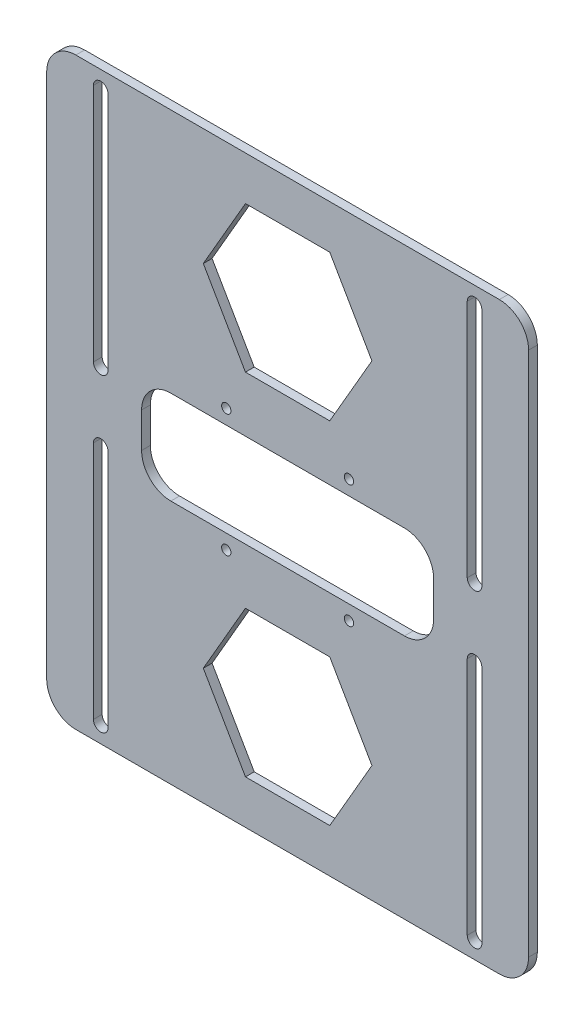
ISO-10303-21;
HEADER;
FILE_DESCRIPTION(('STEP AP214'),'2;1');
FILE_NAME('part.step','',(''),(''),'','','');
FILE_SCHEMA(('AUTOMOTIVE_DESIGN { 1 0 10303 214 1 1 1 1 }'));
ENDSEC;
DATA;
#1=APPLICATION_CONTEXT('core data for automotive mechanical design processes');
#2=APPLICATION_PROTOCOL_DEFINITION('international standard','automotive_design',2000,#1);
#3=PRODUCT_CONTEXT('',#1,'mechanical');
#4=PRODUCT('Part','Part','',(#3));
#5=PRODUCT_RELATED_PRODUCT_CATEGORY('part','',(#4));
#6=PRODUCT_DEFINITION_FORMATION('','',#4);
#7=PRODUCT_DEFINITION_CONTEXT('part definition',#1,'design');
#8=PRODUCT_DEFINITION('design','',#6,#7);
#9=PRODUCT_DEFINITION_SHAPE('','',#8);
#10=(LENGTH_UNIT() NAMED_UNIT(*) SI_UNIT(.MILLI.,.METRE.));
#11=(NAMED_UNIT(*) PLANE_ANGLE_UNIT() SI_UNIT($,.RADIAN.));
#12=(NAMED_UNIT(*) SI_UNIT($,.STERADIAN.) SOLID_ANGLE_UNIT());
#13=UNCERTAINTY_MEASURE_WITH_UNIT(LENGTH_MEASURE(1.E-05),#10,'distance_accuracy_value','');
#14=(GEOMETRIC_REPRESENTATION_CONTEXT(3) GLOBAL_UNCERTAINTY_ASSIGNED_CONTEXT((#13)) GLOBAL_UNIT_ASSIGNED_CONTEXT((#10,
#11,#12)) REPRESENTATION_CONTEXT('',''));
#15=CARTESIAN_POINT('',(0.,0.,0.));
#16=DIRECTION('',(0.,0.,1.));
#17=DIRECTION('',(1.,0.,0.));
#18=AXIS2_PLACEMENT_3D('',#15,#16,#17);
#19=CARTESIAN_POINT('',(0.,0.,3.));
#20=DIRECTION('',(0.,0.,1.));
#21=DIRECTION('',(1.,0.,0.));
#22=AXIS2_PLACEMENT_3D('',#19,#20,#21);
#23=PLANE('',#22);
#24=DIRECTION('',(0.499859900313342,0.866106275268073,0.));
#25=VECTOR('',#24,1.);
#26=CARTESIAN_POINT('',(14.4378006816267,-84.9976647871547,3.));
#27=LINE('',#26,#25);
#28=CARTESIAN_POINT('',(14.4378006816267,-84.9976647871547,3.));
#29=VERTEX_POINT('',#28);
#30=CARTESIAN_POINT('',(28.867513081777,-59.9953302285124,3.));
#31=VERTEX_POINT('',#30);
#32=EDGE_CURVE('E49',#29,#31,#27,.T.);
#33=ORIENTED_EDGE('',*,*,#32,.F.);
#34=DIRECTION('',(0.99999998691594,0.000161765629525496,0.));
#35=VECTOR('',#34,1.);
#36=CARTESIAN_POINT('',(-14.4297124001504,-85.0023345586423,3.));
#37=LINE('',#36,#35);
#38=CARTESIAN_POINT('',(-14.4297124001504,-85.0023345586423,3.));
#39=VERTEX_POINT('',#38);
#40=EDGE_CURVE('E342',#39,#29,#37,.T.);
#41=ORIENTED_EDGE('',*,*,#40,.F.);
#42=DIRECTION('',(0.500140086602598,-0.865944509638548,0.));
#43=VECTOR('',#42,1.);
#44=CARTESIAN_POINT('',(-28.867513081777,-60.0046697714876,3.));
#45=LINE('',#44,#43);
#46=CARTESIAN_POINT('',(-28.867513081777,-60.0046697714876,3.));
#47=VERTEX_POINT('',#46);
#48=EDGE_CURVE('E336',#47,#39,#45,.T.);
#49=ORIENTED_EDGE('',*,*,#48,.F.);
#50=DIRECTION('',(-0.499859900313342,-0.866106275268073,0.));
#51=VECTOR('',#50,1.);
#52=CARTESIAN_POINT('',(-14.4378006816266,-35.0023352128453,3.));
#53=LINE('',#52,#51);
#54=CARTESIAN_POINT('',(-14.4378006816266,-35.0023352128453,3.));
#55=VERTEX_POINT('',#54);
#56=EDGE_CURVE('E334',#55,#47,#53,.T.);
#57=ORIENTED_EDGE('',*,*,#56,.F.);
#58=DIRECTION('',(-0.999999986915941,-0.000161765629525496,0.));
#59=VECTOR('',#58,1.);
#60=CARTESIAN_POINT('',(14.4297124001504,-34.9976654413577,3.));
#61=LINE('',#60,#59);
#62=CARTESIAN_POINT('',(14.4297124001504,-34.9976654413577,3.));
#63=VERTEX_POINT('',#62);
#64=EDGE_CURVE('E318',#63,#55,#61,.T.);
#65=ORIENTED_EDGE('',*,*,#64,.F.);
#66=DIRECTION('',(-0.500140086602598,0.865944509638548,0.));
#67=VECTOR('',#66,1.);
#68=CARTESIAN_POINT('',(28.867513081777,-59.9953302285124,3.));
#69=LINE('',#68,#67);
#70=EDGE_CURVE('E327',#31,#63,#69,.T.);
#71=ORIENTED_EDGE('',*,*,#70,.F.);
#72=EDGE_LOOP('',(#33,#41,#49,#57,#65,#71));
#73=FACE_BOUND('',#72,.T.);
#74=DIRECTION('',(0.500180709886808,0.865921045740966,0.));
#75=VECTOR('',#74,1.);
#76=CARTESIAN_POINT('',(14.428539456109,34.996988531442,3.));
#77=LINE('',#76,#75);
#78=CARTESIAN_POINT('',(14.428539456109,34.996988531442,3.));
#79=VERTEX_POINT('',#78);
#80=CARTESIAN_POINT('',(28.8675128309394,59.9939759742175,3.));
#81=VERTEX_POINT('',#80);
#82=EDGE_CURVE('E347',#79,#81,#77,.T.);
#83=ORIENTED_EDGE('',*,*,#82,.F.);
#84=DIRECTION('',(0.999999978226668,-0.000208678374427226,0.));
#85=VECTOR('',#84,1.);
#86=CARTESIAN_POINT('',(-14.4389733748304,35.0030125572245,3.));
#87=LINE('',#86,#85);
#88=CARTESIAN_POINT('',(-14.4389733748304,35.0030125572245,3.));
#89=VERTEX_POINT('',#88);
#90=EDGE_CURVE('E367',#89,#79,#87,.T.);
#91=ORIENTED_EDGE('',*,*,#90,.F.);
#92=DIRECTION('',(0.49981926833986,-0.866129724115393,0.));
#93=VECTOR('',#92,1.);
#94=CARTESIAN_POINT('',(-28.8675128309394,60.0060240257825,3.));
#95=LINE('',#94,#93);
#96=CARTESIAN_POINT('',(-28.8675128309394,60.0060240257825,3.));
#97=VERTEX_POINT('',#96);
#98=EDGE_CURVE('E364',#97,#89,#95,.T.);
#99=ORIENTED_EDGE('',*,*,#98,.F.);
#100=DIRECTION('',(-0.500180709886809,-0.865921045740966,0.));
#101=VECTOR('',#100,1.);
#102=CARTESIAN_POINT('',(-14.428539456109,85.003011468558,3.));
#103=LINE('',#102,#101);
#104=CARTESIAN_POINT('',(-14.428539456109,85.003011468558,3.));
#105=VERTEX_POINT('',#104);
#106=EDGE_CURVE('E361',#105,#97,#103,.T.);
#107=ORIENTED_EDGE('',*,*,#106,.F.);
#108=DIRECTION('',(-0.999999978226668,0.000208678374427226,0.));
#109=VECTOR('',#108,1.);
#110=CARTESIAN_POINT('',(14.4389733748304,84.9969874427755,3.));
#111=LINE('',#110,#109);
#112=CARTESIAN_POINT('',(14.4389733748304,84.9969874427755,3.));
#113=VERTEX_POINT('',#112);
#114=EDGE_CURVE('E358',#113,#105,#111,.T.);
#115=ORIENTED_EDGE('',*,*,#114,.F.);
#116=DIRECTION('',(-0.49981926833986,0.866129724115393,0.));
#117=VECTOR('',#116,1.);
#118=CARTESIAN_POINT('',(28.8675128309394,59.9939759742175,3.));
#119=LINE('',#118,#117);
#120=EDGE_CURVE('E355',#81,#113,#119,.T.);
#121=ORIENTED_EDGE('',*,*,#120,.F.);
#122=EDGE_LOOP('',(#83,#91,#99,#107,#115,#121));
#123=FACE_BOUND('',#122,.T.);
#124=CARTESIAN_POINT('',(64.,94.,3.));
#125=DIRECTION('',(0.,0.,1.));
#126=DIRECTION('',(1.,0.,0.));
#127=AXIS2_PLACEMENT_3D('',#124,#125,#126);
#128=CIRCLE('',#127,2.49999999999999);
#129=CARTESIAN_POINT('',(66.5,94.,3.));
#130=VERTEX_POINT('',#129);
#131=CARTESIAN_POINT('',(61.5,94.,3.));
#132=VERTEX_POINT('',#131);
#133=EDGE_CURVE('E419',#130,#132,#128,.T.);
#134=ORIENTED_EDGE('',*,*,#133,.F.);
#135=DIRECTION('',(0.,1.,0.));
#136=VECTOR('',#135,1.);
#137=CARTESIAN_POINT('',(66.5,94.,3.));
#138=LINE('',#137,#136);
#139=CARTESIAN_POINT('',(66.5,12.,3.));
#140=VERTEX_POINT('',#139);
#141=EDGE_CURVE('E433',#140,#130,#138,.T.);
#142=ORIENTED_EDGE('',*,*,#141,.F.);
#143=CARTESIAN_POINT('',(64.,12.,3.));
#144=DIRECTION('',(0.,0.,1.));
#145=DIRECTION('',(1.,0.,0.));
#146=AXIS2_PLACEMENT_3D('',#143,#144,#145);
#147=CIRCLE('',#146,2.50000000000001);
#148=CARTESIAN_POINT('',(61.5,12.,3.));
#149=VERTEX_POINT('',#148);
#150=EDGE_CURVE('E430',#149,#140,#147,.T.);
#151=ORIENTED_EDGE('',*,*,#150,.F.);
#152=DIRECTION('',(0.,-1.,0.));
#153=VECTOR('',#152,1.);
#154=CARTESIAN_POINT('',(61.5,94.,3.));
#155=LINE('',#154,#153);
#156=EDGE_CURVE('E427',#132,#149,#155,.T.);
#157=ORIENTED_EDGE('',*,*,#156,.F.);
#158=EDGE_LOOP('',(#134,#142,#151,#157));
#159=FACE_BOUND('',#158,.T.);
#160=CARTESIAN_POINT('',(-64.,94.,3.));
#161=DIRECTION('',(0.,0.,1.));
#162=DIRECTION('',(1.,0.,0.));
#163=AXIS2_PLACEMENT_3D('',#160,#161,#162);
#164=CIRCLE('',#163,2.49999999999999);
#165=CARTESIAN_POINT('',(-61.5,94.,3.));
#166=VERTEX_POINT('',#165);
#167=CARTESIAN_POINT('',(-66.5,94.,3.));
#168=VERTEX_POINT('',#167);
#169=EDGE_CURVE('E439',#166,#168,#164,.T.);
#170=ORIENTED_EDGE('',*,*,#169,.F.);
#171=DIRECTION('',(0.,1.,0.));
#172=VECTOR('',#171,1.);
#173=CARTESIAN_POINT('',(-61.5,94.,3.));
#174=LINE('',#173,#172);
#175=CARTESIAN_POINT('',(-61.5,12.,3.));
#176=VERTEX_POINT('',#175);
#177=EDGE_CURVE('E453',#176,#166,#174,.T.);
#178=ORIENTED_EDGE('',*,*,#177,.F.);
#179=CARTESIAN_POINT('',(-64.,12.,3.));
#180=DIRECTION('',(0.,0.,1.));
#181=DIRECTION('',(1.,0.,0.));
#182=AXIS2_PLACEMENT_3D('',#179,#180,#181);
#183=CIRCLE('',#182,2.49999999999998);
#184=CARTESIAN_POINT('',(-66.4999999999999,12.,3.));
#185=VERTEX_POINT('',#184);
#186=EDGE_CURVE('E450',#185,#176,#183,.T.);
#187=ORIENTED_EDGE('',*,*,#186,.F.);
#188=DIRECTION('',(0.,-1.,0.));
#189=VECTOR('',#188,1.);
#190=CARTESIAN_POINT('',(-66.5,94.,3.));
#191=LINE('',#190,#189);
#192=EDGE_CURVE('E447',#168,#185,#191,.T.);
#193=ORIENTED_EDGE('',*,*,#192,.F.);
#194=EDGE_LOOP('',(#170,#178,#187,#193));
#195=FACE_BOUND('',#194,.T.);
#196=DIRECTION('',(0.,1.,0.));
#197=VECTOR('',#196,1.);
#198=CARTESIAN_POINT('',(50.,-16.,3.));
#199=LINE('',#198,#197);
#200=CARTESIAN_POINT('',(50.,-6.,3.));
#201=VERTEX_POINT('',#200);
#202=CARTESIAN_POINT('',(50.,5.99999999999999,3.));
#203=VERTEX_POINT('',#202);
#204=EDGE_CURVE('E459',#201,#203,#199,.T.);
#205=ORIENTED_EDGE('',*,*,#204,.F.);
#206=CARTESIAN_POINT('',(40.,-6.,3.));
#207=DIRECTION('',(0.,0.,1.));
#208=DIRECTION('',(1.,0.,0.));
#209=AXIS2_PLACEMENT_3D('',#206,#207,#208);
#210=CIRCLE('',#209,10.);
#211=CARTESIAN_POINT('',(40.,-16.,3.));
#212=VERTEX_POINT('',#211);
#213=EDGE_CURVE('E557',#201,#212,#210,.F.);
#214=ORIENTED_EDGE('',*,*,#213,.T.);
#215=DIRECTION('',(1.,0.,0.));
#216=VECTOR('',#215,1.);
#217=CARTESIAN_POINT('',(-50.,-16.,3.));
#218=LINE('',#217,#216);
#219=CARTESIAN_POINT('',(-40.,-16.,3.));
#220=VERTEX_POINT('',#219);
#221=EDGE_CURVE('E470',#220,#212,#218,.T.);
#222=ORIENTED_EDGE('',*,*,#221,.F.);
#223=CARTESIAN_POINT('',(-40.,-6.,3.));
#224=DIRECTION('',(0.,0.,1.));
#225=DIRECTION('',(1.,0.,0.));
#226=AXIS2_PLACEMENT_3D('',#223,#224,#225);
#227=CIRCLE('',#226,10.);
#228=CARTESIAN_POINT('',(-50.,-6.,3.));
#229=VERTEX_POINT('',#228);
#230=EDGE_CURVE('E561',#220,#229,#227,.F.);
#231=ORIENTED_EDGE('',*,*,#230,.T.);
#232=DIRECTION('',(0.,-1.,0.));
#233=VECTOR('',#232,1.);
#234=CARTESIAN_POINT('',(-50.,-16.,3.));
#235=LINE('',#234,#233);
#236=CARTESIAN_POINT('',(-50.,5.99999999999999,3.));
#237=VERTEX_POINT('',#236);
#238=EDGE_CURVE('E485',#237,#229,#235,.T.);
#239=ORIENTED_EDGE('',*,*,#238,.F.);
#240=CARTESIAN_POINT('',(-40.,5.99999999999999,3.));
#241=DIRECTION('',(0.,0.,1.));
#242=DIRECTION('',(1.,0.,0.));
#243=AXIS2_PLACEMENT_3D('',#240,#241,#242);
#244=CIRCLE('',#243,10.);
#245=CARTESIAN_POINT('',(-40.,16.,3.));
#246=VERTEX_POINT('',#245);
#247=EDGE_CURVE('E569',#237,#246,#244,.F.);
#248=ORIENTED_EDGE('',*,*,#247,.T.);
#249=DIRECTION('',(-1.,0.,0.));
#250=VECTOR('',#249,1.);
#251=CARTESIAN_POINT('',(-50.,16.,3.));
#252=LINE('',#251,#250);
#253=CARTESIAN_POINT('',(40.,16.,3.));
#254=VERTEX_POINT('',#253);
#255=EDGE_CURVE('E482',#254,#246,#252,.T.);
#256=ORIENTED_EDGE('',*,*,#255,.F.);
#257=CARTESIAN_POINT('',(40.,6.,3.));
#258=DIRECTION('',(0.,0.,1.));
#259=DIRECTION('',(1.,0.,0.));
#260=AXIS2_PLACEMENT_3D('',#257,#258,#259);
#261=CIRCLE('',#260,10.);
#262=EDGE_CURVE('E565',#254,#203,#261,.F.);
#263=ORIENTED_EDGE('',*,*,#262,.T.);
#264=EDGE_LOOP('',(#205,#214,#222,#231,#239,#248,#256,#263));
#265=FACE_BOUND('',#264,.T.);
#266=CARTESIAN_POINT('',(-21.,21.,3.));
#267=DIRECTION('',(0.,0.,1.));
#268=DIRECTION('',(1.,0.,0.));
#269=AXIS2_PLACEMENT_3D('',#266,#267,#268);
#270=CIRCLE('',#269,1.6);
#271=CARTESIAN_POINT('',(-19.4,21.,3.));
#272=VERTEX_POINT('',#271);
#273=EDGE_CURVE('E479',#272,#272,#270,.T.);
#274=ORIENTED_EDGE('',*,*,#273,.F.);
#275=EDGE_LOOP('',(#274));
#276=FACE_BOUND('',#275,.T.);
#277=CARTESIAN_POINT('',(-21.,-21.,3.));
#278=DIRECTION('',(0.,0.,1.));
#279=DIRECTION('',(1.,0.,0.));
#280=AXIS2_PLACEMENT_3D('',#277,#278,#279);
#281=CIRCLE('',#280,1.6);
#282=CARTESIAN_POINT('',(-19.4,-21.,3.));
#283=VERTEX_POINT('',#282);
#284=EDGE_CURVE('E495',#283,#283,#281,.T.);
#285=ORIENTED_EDGE('',*,*,#284,.F.);
#286=EDGE_LOOP('',(#285));
#287=FACE_BOUND('',#286,.T.);
#288=CARTESIAN_POINT('',(21.,21.,3.));
#289=DIRECTION('',(0.,0.,1.));
#290=DIRECTION('',(1.,0.,0.));
#291=AXIS2_PLACEMENT_3D('',#288,#289,#290);
#292=CIRCLE('',#291,1.6);
#293=CARTESIAN_POINT('',(22.6,21.,3.));
#294=VERTEX_POINT('',#293);
#295=EDGE_CURVE('E501',#294,#294,#292,.T.);
#296=ORIENTED_EDGE('',*,*,#295,.F.);
#297=EDGE_LOOP('',(#296));
#298=FACE_BOUND('',#297,.T.);
#299=CARTESIAN_POINT('',(21.,-21.,3.));
#300=DIRECTION('',(0.,0.,1.));
#301=DIRECTION('',(1.,0.,0.));
#302=AXIS2_PLACEMENT_3D('',#299,#300,#301);
#303=CIRCLE('',#302,1.6);
#304=CARTESIAN_POINT('',(22.6,-21.,3.));
#305=VERTEX_POINT('',#304);
#306=EDGE_CURVE('E507',#305,#305,#303,.T.);
#307=ORIENTED_EDGE('',*,*,#306,.F.);
#308=EDGE_LOOP('',(#307));
#309=FACE_BOUND('',#308,.T.);
#310=DIRECTION('',(1.,0.,0.));
#311=VECTOR('',#310,1.);
#312=CARTESIAN_POINT('',(-82.5,-100.,3.));
#313=LINE('',#312,#311);
#314=CARTESIAN_POINT('',(-72.5,-100.,3.));
#315=VERTEX_POINT('',#314);
#316=CARTESIAN_POINT('',(72.5,-100.,3.));
#317=VERTEX_POINT('',#316);
#318=EDGE_CURVE('E524',#315,#317,#313,.T.);
#319=ORIENTED_EDGE('',*,*,#318,.T.);
#320=CARTESIAN_POINT('',(72.5000000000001,-90.,3.));
#321=DIRECTION('',(0.,0.,1.));
#322=DIRECTION('',(1.,0.,0.));
#323=AXIS2_PLACEMENT_3D('',#320,#321,#322);
#324=CIRCLE('',#323,10.);
#325=CARTESIAN_POINT('',(82.5,-90.,3.));
#326=VERTEX_POINT('',#325);
#327=EDGE_CURVE('E621',#317,#326,#324,.T.);
#328=ORIENTED_EDGE('',*,*,#327,.T.);
#329=DIRECTION('',(0.,1.,0.));
#330=VECTOR('',#329,1.);
#331=CARTESIAN_POINT('',(82.5,100.,3.));
#332=LINE('',#331,#330);
#333=CARTESIAN_POINT('',(82.5,90.,3.));
#334=VERTEX_POINT('',#333);
#335=EDGE_CURVE('E514',#326,#334,#332,.T.);
#336=ORIENTED_EDGE('',*,*,#335,.T.);
#337=CARTESIAN_POINT('',(72.5,90.,3.));
#338=DIRECTION('',(0.,0.,1.));
#339=DIRECTION('',(1.,0.,0.));
#340=AXIS2_PLACEMENT_3D('',#337,#338,#339);
#341=CIRCLE('',#340,10.);
#342=CARTESIAN_POINT('',(72.5,100.,3.));
#343=VERTEX_POINT('',#342);
#344=EDGE_CURVE('E617',#334,#343,#341,.T.);
#345=ORIENTED_EDGE('',*,*,#344,.T.);
#346=DIRECTION('',(-1.,0.,0.));
#347=VECTOR('',#346,1.);
#348=CARTESIAN_POINT('',(-82.5,100.,3.));
#349=LINE('',#348,#347);
#350=CARTESIAN_POINT('',(-72.5,100.,3.));
#351=VERTEX_POINT('',#350);
#352=EDGE_CURVE('E517',#343,#351,#349,.T.);
#353=ORIENTED_EDGE('',*,*,#352,.T.);
#354=CARTESIAN_POINT('',(-72.5,90.,3.));
#355=DIRECTION('',(0.,0.,1.));
#356=DIRECTION('',(1.,0.,0.));
#357=AXIS2_PLACEMENT_3D('',#354,#355,#356);
#358=CIRCLE('',#357,10.);
#359=CARTESIAN_POINT('',(-82.5,90.,3.));
#360=VERTEX_POINT('',#359);
#361=EDGE_CURVE('E615',#351,#360,#358,.T.);
#362=ORIENTED_EDGE('',*,*,#361,.T.);
#363=DIRECTION('',(0.,-1.,0.));
#364=VECTOR('',#363,1.);
#365=CARTESIAN_POINT('',(-82.5,100.,3.));
#366=LINE('',#365,#364);
#367=CARTESIAN_POINT('',(-82.5,-90.,3.));
#368=VERTEX_POINT('',#367);
#369=EDGE_CURVE('E521',#360,#368,#366,.T.);
#370=ORIENTED_EDGE('',*,*,#369,.T.);
#371=CARTESIAN_POINT('',(-72.5,-90.,3.));
#372=DIRECTION('',(0.,0.,1.));
#373=DIRECTION('',(1.,0.,0.));
#374=AXIS2_PLACEMENT_3D('',#371,#372,#373);
#375=CIRCLE('',#374,10.);
#376=EDGE_CURVE('E619',#368,#315,#375,.T.);
#377=ORIENTED_EDGE('',*,*,#376,.T.);
#378=EDGE_LOOP('',(#319,#328,#336,#345,#353,#362,#370,#377));
#379=FACE_BOUND('',#378,.T.);
#380=DIRECTION('',(0.,-1.,0.));
#381=VECTOR('',#380,1.);
#382=CARTESIAN_POINT('',(-61.5,-94.,3.));
#383=LINE('',#382,#381);
#384=CARTESIAN_POINT('',(-61.5,-12.,3.));
#385=VERTEX_POINT('',#384);
#386=CARTESIAN_POINT('',(-61.5,-94.,3.));
#387=VERTEX_POINT('',#386);
#388=EDGE_CURVE('E407',#385,#387,#383,.T.);
#389=ORIENTED_EDGE('',*,*,#388,.T.);
#390=CARTESIAN_POINT('',(-64.,-94.,3.));
#391=DIRECTION('',(0.,0.,-1.));
#392=DIRECTION('',(1.,0.,0.));
#393=AXIS2_PLACEMENT_3D('',#390,#391,#392);
#394=CIRCLE('',#393,2.49999999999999);
#395=CARTESIAN_POINT('',(-66.5,-94.,3.));
#396=VERTEX_POINT('',#395);
#397=EDGE_CURVE('E398',#387,#396,#394,.T.);
#398=ORIENTED_EDGE('',*,*,#397,.T.);
#399=DIRECTION('',(0.,1.,0.));
#400=VECTOR('',#399,1.);
#401=CARTESIAN_POINT('',(-66.5,-94.,3.));
#402=LINE('',#401,#400);
#403=CARTESIAN_POINT('',(-66.4999999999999,-12.,3.));
#404=VERTEX_POINT('',#403);
#405=EDGE_CURVE('E413',#396,#404,#402,.T.);
#406=ORIENTED_EDGE('',*,*,#405,.T.);
#407=CARTESIAN_POINT('',(-64.,-12.,3.));
#408=DIRECTION('',(0.,0.,-1.));
#409=DIRECTION('',(1.,0.,0.));
#410=AXIS2_PLACEMENT_3D('',#407,#408,#409);
#411=CIRCLE('',#410,2.49999999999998);
#412=EDGE_CURVE('E410',#404,#385,#411,.T.);
#413=ORIENTED_EDGE('',*,*,#412,.T.);
#414=EDGE_LOOP('',(#389,#398,#406,#413));
#415=FACE_BOUND('',#414,.T.);
#416=DIRECTION('',(0.,-1.,0.));
#417=VECTOR('',#416,1.);
#418=CARTESIAN_POINT('',(66.5,-94.,3.));
#419=LINE('',#418,#417);
#420=CARTESIAN_POINT('',(66.5,-12.,3.));
#421=VERTEX_POINT('',#420);
#422=CARTESIAN_POINT('',(66.5,-94.,3.));
#423=VERTEX_POINT('',#422);
#424=EDGE_CURVE('E386',#421,#423,#419,.T.);
#425=ORIENTED_EDGE('',*,*,#424,.T.);
#426=CARTESIAN_POINT('',(64.,-94.,3.));
#427=DIRECTION('',(0.,0.,-1.));
#428=DIRECTION('',(1.,0.,0.));
#429=AXIS2_PLACEMENT_3D('',#426,#427,#428);
#430=CIRCLE('',#429,2.49999999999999);
#431=CARTESIAN_POINT('',(61.5,-94.,3.));
#432=VERTEX_POINT('',#431);
#433=EDGE_CURVE('E373',#423,#432,#430,.T.);
#434=ORIENTED_EDGE('',*,*,#433,.T.);
#435=DIRECTION('',(0.,1.,0.));
#436=VECTOR('',#435,1.);
#437=CARTESIAN_POINT('',(61.5,-94.,3.));
#438=LINE('',#437,#436);
#439=CARTESIAN_POINT('',(61.5,-12.,3.));
#440=VERTEX_POINT('',#439);
#441=EDGE_CURVE('E392',#432,#440,#438,.T.);
#442=ORIENTED_EDGE('',*,*,#441,.T.);
#443=CARTESIAN_POINT('',(64.,-12.,3.));
#444=DIRECTION('',(0.,0.,-1.));
#445=DIRECTION('',(1.,0.,0.));
#446=AXIS2_PLACEMENT_3D('',#443,#444,#445);
#447=CIRCLE('',#446,2.50000000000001);
#448=EDGE_CURVE('E389',#440,#421,#447,.T.);
#449=ORIENTED_EDGE('',*,*,#448,.T.);
#450=EDGE_LOOP('',(#425,#434,#442,#449));
#451=FACE_BOUND('',#450,.T.);
#452=ADVANCED_FACE('F34',(#73,#123,#159,#195,#265,#276,#287,#298,#309,#379,#415,#451),#23,.T.);
#453=CARTESIAN_POINT('',(0.,0.,0.));
#454=DIRECTION('',(0.,0.,1.));
#455=DIRECTION('',(1.,0.,0.));
#456=AXIS2_PLACEMENT_3D('',#453,#454,#455);
#457=PLANE('',#456);
#458=DIRECTION('',(0.99999998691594,0.000161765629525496,0.));
#459=VECTOR('',#458,1.);
#460=CARTESIAN_POINT('',(0.0137500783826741,-84.9999981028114,0.));
#461=LINE('',#460,#459);
#462=CARTESIAN_POINT('',(-14.4297124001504,-85.0023345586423,0.));
#463=VERTEX_POINT('',#462);
#464=CARTESIAN_POINT('',(14.4378006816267,-84.9976647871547,0.));
#465=VERTEX_POINT('',#464);
#466=EDGE_CURVE('E42',#463,#465,#461,.T.);
#467=ORIENTED_EDGE('',*,*,#466,.T.);
#468=DIRECTION('',(0.499859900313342,0.866106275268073,0.));
#469=VECTOR('',#468,1.);
#470=CARTESIAN_POINT('',(47.6285646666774,-27.4880927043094,0.));
#471=LINE('',#470,#469);
#472=CARTESIAN_POINT('',(28.867513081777,-59.9953302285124,0.));
#473=VERTEX_POINT('',#472);
#474=EDGE_CURVE('E11',#465,#473,#471,.T.);
#475=ORIENTED_EDGE('',*,*,#474,.T.);
#476=DIRECTION('',(-0.500140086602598,0.865944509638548,0.));
#477=VECTOR('',#476,1.);
#478=CARTESIAN_POINT('',(-4.33700098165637,-2.50490420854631,0.));
#479=LINE('',#478,#477);
#480=CARTESIAN_POINT('',(14.4297124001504,-34.9976654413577,0.));
#481=VERTEX_POINT('',#480);
#482=EDGE_CURVE('E669',#473,#481,#479,.T.);
#483=ORIENTED_EDGE('',*,*,#482,.T.);
#484=DIRECTION('',(-0.99999998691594,-0.000161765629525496,0.));
#485=VECTOR('',#484,1.);
#486=CARTESIAN_POINT('',(0.00566179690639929,-34.9999987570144,0.));
#487=LINE('',#486,#485);
#488=CARTESIAN_POINT('',(-14.4378006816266,-35.0023352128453,0.));
#489=VERTEX_POINT('',#488);
#490=EDGE_CURVE('E321',#481,#489,#487,.T.);
#491=ORIENTED_EDGE('',*,*,#490,.T.);
#492=DIRECTION('',(-0.499859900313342,-0.866106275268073,0.));
#493=VECTOR('',#492,1.);
#494=CARTESIAN_POINT('',(4.32325090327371,-2.4950976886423,0.));
#495=LINE('',#494,#493);
#496=CARTESIAN_POINT('',(-28.867513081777,-60.0046697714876,0.));
#497=VERTEX_POINT('',#496);
#498=EDGE_CURVE('E672',#489,#497,#495,.T.);
#499=ORIENTED_EDGE('',*,*,#498,.T.);
#500=DIRECTION('',(0.500140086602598,-0.865944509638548,0.));
#501=VECTOR('',#500,1.);
#502=CARTESIAN_POINT('',(-47.6342264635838,-27.5119085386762,0.));
#503=LINE('',#502,#501);
#504=EDGE_CURVE('E675',#497,#463,#503,.T.);
#505=ORIENTED_EDGE('',*,*,#504,.T.);
#506=EDGE_LOOP('',(#467,#475,#483,#491,#499,#505));
#507=FACE_BOUND('',#506,.T.);
#508=DIRECTION('',(0.999999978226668,-0.000208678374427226,0.));
#509=VECTOR('',#508,1.);
#510=CARTESIAN_POINT('',(0.00730374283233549,34.9999979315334,0.));
#511=LINE('',#510,#509);
#512=CARTESIAN_POINT('',(-14.4389733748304,35.0030125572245,0.));
#513=VERTEX_POINT('',#512);
#514=CARTESIAN_POINT('',(14.428539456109,34.996988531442,0.));
#515=VERTEX_POINT('',#514);
#516=EDGE_CURVE('E663',#513,#515,#511,.T.);
#517=ORIENTED_EDGE('',*,*,#516,.T.);
#518=DIRECTION('',(0.500180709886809,0.865921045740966,0.));
#519=VECTOR('',#518,1.);
#520=CARTESIAN_POINT('',(-4.33899405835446,2.50632680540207,0.));
#521=LINE('',#520,#519);
#522=CARTESIAN_POINT('',(28.8675128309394,59.9939759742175,0.));
#523=VERTEX_POINT('',#522);
#524=EDGE_CURVE('E666',#515,#523,#521,.T.);
#525=ORIENTED_EDGE('',*,*,#524,.T.);
#526=DIRECTION('',(-0.49981926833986,0.866129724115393,0.));
#527=VECTOR('',#526,1.);
#528=CARTESIAN_POINT('',(47.6277426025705,27.4846397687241,0.));
#529=LINE('',#528,#527);
#530=CARTESIAN_POINT('',(14.4389733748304,84.9969874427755,0.));
#531=VERTEX_POINT('',#530);
#532=EDGE_CURVE('E651',#523,#531,#529,.T.);
#533=ORIENTED_EDGE('',*,*,#532,.T.);
#534=DIRECTION('',(-0.999999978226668,0.000208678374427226,0.));
#535=VECTOR('',#534,1.);
#536=CARTESIAN_POINT('',(0.0177376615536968,84.9999968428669,0.));
#537=LINE('',#536,#535);
#538=CARTESIAN_POINT('',(-14.428539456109,85.003011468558,0.));
#539=VERTEX_POINT('',#538);
#540=EDGE_CURVE('E654',#531,#539,#537,.T.);
#541=ORIENTED_EDGE('',*,*,#540,.T.);
#542=DIRECTION('',(-0.500180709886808,-0.865921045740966,0.));
#543=VECTOR('',#542,1.);
#544=CARTESIAN_POINT('',(-47.6350463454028,27.5153622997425,0.));
#545=LINE('',#544,#543);
#546=CARTESIAN_POINT('',(-28.8675128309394,60.0060240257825,0.));
#547=VERTEX_POINT('',#546);
#548=EDGE_CURVE('E657',#539,#547,#545,.T.);
#549=ORIENTED_EDGE('',*,*,#548,.T.);
#550=DIRECTION('',(0.49981926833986,-0.866129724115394,0.));
#551=VECTOR('',#550,1.);
#552=CARTESIAN_POINT('',(4.32125639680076,2.49367635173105,0.));
#553=LINE('',#552,#551);
#554=EDGE_CURVE('E660',#547,#513,#553,.T.);
#555=ORIENTED_EDGE('',*,*,#554,.T.);
#556=EDGE_LOOP('',(#517,#525,#533,#541,#549,#555));
#557=FACE_BOUND('',#556,.T.);
#558=CARTESIAN_POINT('',(-64.,-94.,0.));
#559=DIRECTION('',(0.,0.,1.));
#560=DIRECTION('',(1.,0.,0.));
#561=AXIS2_PLACEMENT_3D('',#558,#559,#560);
#562=CIRCLE('',#561,2.49999999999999);
#563=CARTESIAN_POINT('',(-61.5,-94.,0.));
#564=VERTEX_POINT('',#563);
#565=CARTESIAN_POINT('',(-66.5,-94.,0.));
#566=VERTEX_POINT('',#565);
#567=EDGE_CURVE('E640',#564,#566,#562,.F.);
#568=ORIENTED_EDGE('',*,*,#567,.F.);
#569=DIRECTION('',(0.,-1.,0.));
#570=VECTOR('',#569,1.);
#571=CARTESIAN_POINT('',(-61.5,0.,0.));
#572=LINE('',#571,#570);
#573=CARTESIAN_POINT('',(-61.5,-12.,0.));
#574=VERTEX_POINT('',#573);
#575=EDGE_CURVE('E633',#574,#564,#572,.T.);
#576=ORIENTED_EDGE('',*,*,#575,.F.);
#577=CARTESIAN_POINT('',(-64.,-12.,0.));
#578=DIRECTION('',(0.,0.,1.));
#579=DIRECTION('',(1.,0.,0.));
#580=AXIS2_PLACEMENT_3D('',#577,#578,#579);
#581=CIRCLE('',#580,2.49999999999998);
#582=CARTESIAN_POINT('',(-66.4999999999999,-12.,0.));
#583=VERTEX_POINT('',#582);
#584=EDGE_CURVE('E635',#583,#574,#581,.F.);
#585=ORIENTED_EDGE('',*,*,#584,.F.);
#586=DIRECTION('',(0.,1.,0.));
#587=VECTOR('',#586,1.);
#588=CARTESIAN_POINT('',(-66.5,0.,0.));
#589=LINE('',#588,#587);
#590=EDGE_CURVE('E638',#566,#583,#589,.T.);
#591=ORIENTED_EDGE('',*,*,#590,.F.);
#592=EDGE_LOOP('',(#568,#576,#585,#591));
#593=FACE_BOUND('',#592,.T.);
#594=DIRECTION('',(0.,1.,0.));
#595=VECTOR('',#594,1.);
#596=CARTESIAN_POINT('',(66.5,0.,0.));
#597=LINE('',#596,#595);
#598=CARTESIAN_POINT('',(66.5,12.,0.));
#599=VERTEX_POINT('',#598);
#600=CARTESIAN_POINT('',(66.5,94.,0.));
#601=VERTEX_POINT('',#600);
#602=EDGE_CURVE('E591',#599,#601,#597,.T.);
#603=ORIENTED_EDGE('',*,*,#602,.T.);
#604=CARTESIAN_POINT('',(64.,94.,0.));
#605=DIRECTION('',(0.,0.,1.));
#606=DIRECTION('',(1.,0.,0.));
#607=AXIS2_PLACEMENT_3D('',#604,#605,#606);
#608=CIRCLE('',#607,2.49999999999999);
#609=CARTESIAN_POINT('',(61.5,94.,0.));
#610=VERTEX_POINT('',#609);
#611=EDGE_CURVE('E594',#601,#610,#608,.T.);
#612=ORIENTED_EDGE('',*,*,#611,.T.);
#613=DIRECTION('',(0.,-1.,0.));
#614=VECTOR('',#613,1.);
#615=CARTESIAN_POINT('',(61.5,0.,0.));
#616=LINE('',#615,#614);
#617=CARTESIAN_POINT('',(61.5,12.,0.));
#618=VERTEX_POINT('',#617);
#619=EDGE_CURVE('E585',#610,#618,#616,.T.);
#620=ORIENTED_EDGE('',*,*,#619,.T.);
#621=CARTESIAN_POINT('',(64.,12.,0.));
#622=DIRECTION('',(0.,0.,1.));
#623=DIRECTION('',(1.,0.,0.));
#624=AXIS2_PLACEMENT_3D('',#621,#622,#623);
#625=CIRCLE('',#624,2.50000000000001);
#626=EDGE_CURVE('E588',#618,#599,#625,.T.);
#627=ORIENTED_EDGE('',*,*,#626,.T.);
#628=EDGE_LOOP('',(#603,#612,#620,#627));
#629=FACE_BOUND('',#628,.T.);
#630=DIRECTION('',(0.,1.,0.));
#631=VECTOR('',#630,1.);
#632=CARTESIAN_POINT('',(-61.5,0.,0.));
#633=LINE('',#632,#631);
#634=CARTESIAN_POINT('',(-61.5,12.,0.));
#635=VERTEX_POINT('',#634);
#636=CARTESIAN_POINT('',(-61.5,94.,0.));
#637=VERTEX_POINT('',#636);
#638=EDGE_CURVE('E579',#635,#637,#633,.T.);
#639=ORIENTED_EDGE('',*,*,#638,.T.);
#640=CARTESIAN_POINT('',(-64.,94.,0.));
#641=DIRECTION('',(0.,0.,1.));
#642=DIRECTION('',(1.,0.,0.));
#643=AXIS2_PLACEMENT_3D('',#640,#641,#642);
#644=CIRCLE('',#643,2.49999999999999);
#645=CARTESIAN_POINT('',(-66.5,94.,0.));
#646=VERTEX_POINT('',#645);
#647=EDGE_CURVE('E582',#637,#646,#644,.T.);
#648=ORIENTED_EDGE('',*,*,#647,.T.);
#649=DIRECTION('',(0.,-1.,0.));
#650=VECTOR('',#649,1.);
#651=CARTESIAN_POINT('',(-66.5,0.,0.));
#652=LINE('',#651,#650);
#653=CARTESIAN_POINT('',(-66.5,12.,0.));
#654=VERTEX_POINT('',#653);
#655=EDGE_CURVE('E573',#646,#654,#652,.T.);
#656=ORIENTED_EDGE('',*,*,#655,.T.);
#657=CARTESIAN_POINT('',(-64.,12.,0.));
#658=DIRECTION('',(0.,0.,1.));
#659=DIRECTION('',(1.,0.,0.));
#660=AXIS2_PLACEMENT_3D('',#657,#658,#659);
#661=CIRCLE('',#660,2.49999999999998);
#662=EDGE_CURVE('E576',#654,#635,#661,.T.);
#663=ORIENTED_EDGE('',*,*,#662,.T.);
#664=EDGE_LOOP('',(#639,#648,#656,#663));
#665=FACE_BOUND('',#664,.T.);
#666=DIRECTION('',(0.,-1.,0.));
#667=VECTOR('',#666,1.);
#668=CARTESIAN_POINT('',(-50.,-16.,0.));
#669=LINE('',#668,#667);
#670=CARTESIAN_POINT('',(-50.,5.99999999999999,0.));
#671=VERTEX_POINT('',#670);
#672=CARTESIAN_POINT('',(-50.,-6.,0.));
#673=VERTEX_POINT('',#672);
#674=EDGE_CURVE('E473',#671,#673,#669,.T.);
#675=ORIENTED_EDGE('',*,*,#674,.T.);
#676=CARTESIAN_POINT('',(-40.,-6.,0.));
#677=DIRECTION('',(0.,0.,1.));
#678=DIRECTION('',(1.,0.,0.));
#679=AXIS2_PLACEMENT_3D('',#676,#677,#678);
#680=CIRCLE('',#679,10.);
#681=CARTESIAN_POINT('',(-40.,-16.,0.));
#682=VERTEX_POINT('',#681);
#683=EDGE_CURVE('E563',#673,#682,#680,.T.);
#684=ORIENTED_EDGE('',*,*,#683,.T.);
#685=DIRECTION('',(1.,0.,0.));
#686=VECTOR('',#685,1.);
#687=CARTESIAN_POINT('',(-50.,-16.,0.));
#688=LINE('',#687,#686);
#689=CARTESIAN_POINT('',(40.,-16.,0.));
#690=VERTEX_POINT('',#689);
#691=EDGE_CURVE('E476',#682,#690,#688,.T.);
#692=ORIENTED_EDGE('',*,*,#691,.T.);
#693=CARTESIAN_POINT('',(40.,-6.,0.));
#694=DIRECTION('',(0.,0.,1.));
#695=DIRECTION('',(1.,0.,0.));
#696=AXIS2_PLACEMENT_3D('',#693,#694,#695);
#697=CIRCLE('',#696,10.);
#698=CARTESIAN_POINT('',(50.,-6.,0.));
#699=VERTEX_POINT('',#698);
#700=EDGE_CURVE('E559',#690,#699,#697,.T.);
#701=ORIENTED_EDGE('',*,*,#700,.T.);
#702=DIRECTION('',(0.,1.,0.));
#703=VECTOR('',#702,1.);
#704=CARTESIAN_POINT('',(50.,-16.,0.));
#705=LINE('',#704,#703);
#706=CARTESIAN_POINT('',(50.,5.99999999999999,0.));
#707=VERTEX_POINT('',#706);
#708=EDGE_CURVE('E466',#699,#707,#705,.T.);
#709=ORIENTED_EDGE('',*,*,#708,.T.);
#710=CARTESIAN_POINT('',(40.,6.,0.));
#711=DIRECTION('',(0.,0.,1.));
#712=DIRECTION('',(1.,0.,0.));
#713=AXIS2_PLACEMENT_3D('',#710,#711,#712);
#714=CIRCLE('',#713,10.);
#715=CARTESIAN_POINT('',(40.,16.,0.));
#716=VERTEX_POINT('',#715);
#717=EDGE_CURVE('E567',#707,#716,#714,.T.);
#718=ORIENTED_EDGE('',*,*,#717,.T.);
#719=DIRECTION('',(-1.,0.,0.));
#720=VECTOR('',#719,1.);
#721=CARTESIAN_POINT('',(-50.,16.,0.));
#722=LINE('',#721,#720);
#723=CARTESIAN_POINT('',(-40.,16.,0.));
#724=VERTEX_POINT('',#723);
#725=EDGE_CURVE('E469',#716,#724,#722,.T.);
#726=ORIENTED_EDGE('',*,*,#725,.T.);
#727=CARTESIAN_POINT('',(-40.,5.99999999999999,0.));
#728=DIRECTION('',(0.,0.,1.));
#729=DIRECTION('',(1.,0.,0.));
#730=AXIS2_PLACEMENT_3D('',#727,#728,#729);
#731=CIRCLE('',#730,10.);
#732=EDGE_CURVE('E571',#724,#671,#731,.T.);
#733=ORIENTED_EDGE('',*,*,#732,.T.);
#734=EDGE_LOOP('',(#675,#684,#692,#701,#709,#718,#726,#733));
#735=FACE_BOUND('',#734,.T.);
#736=CARTESIAN_POINT('',(-21.,21.,0.));
#737=DIRECTION('',(0.,0.,1.));
#738=DIRECTION('',(1.,0.,0.));
#739=AXIS2_PLACEMENT_3D('',#736,#737,#738);
#740=CIRCLE('',#739,1.6);
#741=CARTESIAN_POINT('',(-19.4,21.,0.));
#742=VERTEX_POINT('',#741);
#743=EDGE_CURVE('E492',#742,#742,#740,.T.);
#744=ORIENTED_EDGE('',*,*,#743,.T.);
#745=EDGE_LOOP('',(#744));
#746=FACE_BOUND('',#745,.T.);
#747=CARTESIAN_POINT('',(-21.,-21.,0.));
#748=DIRECTION('',(0.,0.,1.));
#749=DIRECTION('',(1.,0.,0.));
#750=AXIS2_PLACEMENT_3D('',#747,#748,#749);
#751=CIRCLE('',#750,1.6);
#752=CARTESIAN_POINT('',(-19.4,-21.,0.));
#753=VERTEX_POINT('',#752);
#754=EDGE_CURVE('E498',#753,#753,#751,.T.);
#755=ORIENTED_EDGE('',*,*,#754,.T.);
#756=EDGE_LOOP('',(#755));
#757=FACE_BOUND('',#756,.T.);
#758=CARTESIAN_POINT('',(21.,21.,0.));
#759=DIRECTION('',(0.,0.,1.));
#760=DIRECTION('',(1.,0.,0.));
#761=AXIS2_PLACEMENT_3D('',#758,#759,#760);
#762=CIRCLE('',#761,1.6);
#763=CARTESIAN_POINT('',(22.6,21.,0.));
#764=VERTEX_POINT('',#763);
#765=EDGE_CURVE('E504',#764,#764,#762,.T.);
#766=ORIENTED_EDGE('',*,*,#765,.T.);
#767=EDGE_LOOP('',(#766));
#768=FACE_BOUND('',#767,.T.);
#769=CARTESIAN_POINT('',(21.,-21.,0.));
#770=DIRECTION('',(0.,0.,1.));
#771=DIRECTION('',(1.,0.,0.));
#772=AXIS2_PLACEMENT_3D('',#769,#770,#771);
#773=CIRCLE('',#772,1.6);
#774=CARTESIAN_POINT('',(22.6,-21.,0.));
#775=VERTEX_POINT('',#774);
#776=EDGE_CURVE('E510',#775,#775,#773,.T.);
#777=ORIENTED_EDGE('',*,*,#776,.T.);
#778=EDGE_LOOP('',(#777));
#779=FACE_BOUND('',#778,.T.);
#780=DIRECTION('',(0.,1.,0.));
#781=VECTOR('',#780,1.);
#782=CARTESIAN_POINT('',(82.5,100.,0.));
#783=LINE('',#782,#781);
#784=CARTESIAN_POINT('',(82.5,-90.,0.));
#785=VERTEX_POINT('',#784);
#786=CARTESIAN_POINT('',(82.5,90.,0.));
#787=VERTEX_POINT('',#786);
#788=EDGE_CURVE('E513',#785,#787,#783,.T.);
#789=ORIENTED_EDGE('',*,*,#788,.F.);
#790=CARTESIAN_POINT('',(72.5000000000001,-90.,0.));
#791=DIRECTION('',(0.,0.,1.));
#792=DIRECTION('',(1.,0.,0.));
#793=AXIS2_PLACEMENT_3D('',#790,#791,#792);
#794=CIRCLE('',#793,10.);
#795=CARTESIAN_POINT('',(72.5,-100.,0.));
#796=VERTEX_POINT('',#795);
#797=EDGE_CURVE('E608',#785,#796,#794,.F.);
#798=ORIENTED_EDGE('',*,*,#797,.T.);
#799=DIRECTION('',(1.,0.,0.));
#800=VECTOR('',#799,1.);
#801=CARTESIAN_POINT('',(-82.5,-100.,0.));
#802=LINE('',#801,#800);
#803=CARTESIAN_POINT('',(-72.5,-100.,0.));
#804=VERTEX_POINT('',#803);
#805=EDGE_CURVE('E518',#804,#796,#802,.T.);
#806=ORIENTED_EDGE('',*,*,#805,.F.);
#807=CARTESIAN_POINT('',(-72.5,-90.,0.));
#808=DIRECTION('',(0.,0.,1.));
#809=DIRECTION('',(1.,0.,0.));
#810=AXIS2_PLACEMENT_3D('',#807,#808,#809);
#811=CIRCLE('',#810,10.);
#812=CARTESIAN_POINT('',(-82.5,-90.,0.));
#813=VERTEX_POINT('',#812);
#814=EDGE_CURVE('E606',#804,#813,#811,.F.);
#815=ORIENTED_EDGE('',*,*,#814,.T.);
#816=DIRECTION('',(0.,-1.,0.));
#817=VECTOR('',#816,1.);
#818=CARTESIAN_POINT('',(-82.5,100.,0.));
#819=LINE('',#818,#817);
#820=CARTESIAN_POINT('',(-82.5,90.,0.));
#821=VERTEX_POINT('',#820);
#822=EDGE_CURVE('E533',#821,#813,#819,.T.);
#823=ORIENTED_EDGE('',*,*,#822,.F.);
#824=CARTESIAN_POINT('',(-72.5,90.,0.));
#825=DIRECTION('',(0.,0.,1.));
#826=DIRECTION('',(1.,0.,0.));
#827=AXIS2_PLACEMENT_3D('',#824,#825,#826);
#828=CIRCLE('',#827,10.);
#829=CARTESIAN_POINT('',(-72.5,100.,0.));
#830=VERTEX_POINT('',#829);
#831=EDGE_CURVE('E602',#821,#830,#828,.F.);
#832=ORIENTED_EDGE('',*,*,#831,.T.);
#833=DIRECTION('',(-1.,0.,0.));
#834=VECTOR('',#833,1.);
#835=CARTESIAN_POINT('',(-82.5,100.,0.));
#836=LINE('',#835,#834);
#837=CARTESIAN_POINT('',(72.5,100.,0.));
#838=VERTEX_POINT('',#837);
#839=EDGE_CURVE('E530',#838,#830,#836,.T.);
#840=ORIENTED_EDGE('',*,*,#839,.F.);
#841=CARTESIAN_POINT('',(72.5,90.,0.));
#842=DIRECTION('',(0.,0.,1.));
#843=DIRECTION('',(1.,0.,0.));
#844=AXIS2_PLACEMENT_3D('',#841,#842,#843);
#845=CIRCLE('',#844,10.);
#846=EDGE_CURVE('E604',#838,#787,#845,.F.);
#847=ORIENTED_EDGE('',*,*,#846,.T.);
#848=EDGE_LOOP('',(#789,#798,#806,#815,#823,#832,#840,#847));
#849=FACE_BOUND('',#848,.T.);
#850=CARTESIAN_POINT('',(64.,-94.,0.));
#851=DIRECTION('',(0.,0.,1.));
#852=DIRECTION('',(1.,0.,0.));
#853=AXIS2_PLACEMENT_3D('',#850,#851,#852);
#854=CIRCLE('',#853,2.49999999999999);
#855=CARTESIAN_POINT('',(66.5,-94.,0.));
#856=VERTEX_POINT('',#855);
#857=CARTESIAN_POINT('',(61.5,-94.,0.));
#858=VERTEX_POINT('',#857);
#859=EDGE_CURVE('E649',#856,#858,#854,.F.);
#860=ORIENTED_EDGE('',*,*,#859,.F.);
#861=DIRECTION('',(0.,-1.,0.));
#862=VECTOR('',#861,1.);
#863=CARTESIAN_POINT('',(66.5,0.,0.));
#864=LINE('',#863,#862);
#865=CARTESIAN_POINT('',(66.5,-12.,0.));
#866=VERTEX_POINT('',#865);
#867=EDGE_CURVE('E642',#866,#856,#864,.T.);
#868=ORIENTED_EDGE('',*,*,#867,.F.);
#869=CARTESIAN_POINT('',(64.,-12.,0.));
#870=DIRECTION('',(0.,0.,1.));
#871=DIRECTION('',(1.,0.,0.));
#872=AXIS2_PLACEMENT_3D('',#869,#870,#871);
#873=CIRCLE('',#872,2.50000000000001);
#874=CARTESIAN_POINT('',(61.5,-12.,0.));
#875=VERTEX_POINT('',#874);
#876=EDGE_CURVE('E644',#875,#866,#873,.F.);
#877=ORIENTED_EDGE('',*,*,#876,.F.);
#878=DIRECTION('',(0.,1.,0.));
#879=VECTOR('',#878,1.);
#880=CARTESIAN_POINT('',(61.5,0.,0.));
#881=LINE('',#880,#879);
#882=EDGE_CURVE('E647',#858,#875,#881,.T.);
#883=ORIENTED_EDGE('',*,*,#882,.F.);
#884=EDGE_LOOP('',(#860,#868,#877,#883));
#885=FACE_BOUND('',#884,.T.);
#886=ADVANCED_FACE('F679',(#507,#557,#593,#629,#665,#735,#746,#757,#768,#779,#849,#885),#457,.F.);
#887=CARTESIAN_POINT('',(82.5,100.,3.));
#888=DIRECTION('',(-1.,0.,0.));
#889=DIRECTION('',(0.,-1.,0.));
#890=AXIS2_PLACEMENT_3D('',#887,#888,#889);
#891=PLANE('',#890);
#892=ORIENTED_EDGE('',*,*,#335,.F.);
#893=DIRECTION('',(0.,0.,-1.));
#894=VECTOR('',#893,1.);
#895=CARTESIAN_POINT('',(82.5,-90.,3.));
#896=LINE('',#895,#894);
#897=EDGE_CURVE('E599',#326,#785,#896,.T.);
#898=ORIENTED_EDGE('',*,*,#897,.T.);
#899=ORIENTED_EDGE('',*,*,#788,.T.);
#900=DIRECTION('',(0.,0.,-1.));
#901=VECTOR('',#900,1.);
#902=CARTESIAN_POINT('',(82.5,90.,3.));
#903=LINE('',#902,#901);
#904=EDGE_CURVE('E597',#787,#334,#903,.F.);
#905=ORIENTED_EDGE('',*,*,#904,.T.);
#906=EDGE_LOOP('',(#892,#898,#899,#905));
#907=FACE_BOUND('',#906,.T.);
#908=ADVANCED_FACE('F710',(#907),#891,.F.);
#909=CARTESIAN_POINT('',(-82.5,100.,3.));
#910=DIRECTION('',(0.,-1.,0.));
#911=DIRECTION('',(0.,0.,-1.));
#912=AXIS2_PLACEMENT_3D('',#909,#910,#911);
#913=PLANE('',#912);
#914=ORIENTED_EDGE('',*,*,#352,.F.);
#915=DIRECTION('',(0.,0.,-1.));
#916=VECTOR('',#915,1.);
#917=CARTESIAN_POINT('',(72.5,100.,3.));
#918=LINE('',#917,#916);
#919=EDGE_CURVE('E630',#343,#838,#918,.T.);
#920=ORIENTED_EDGE('',*,*,#919,.T.);
#921=ORIENTED_EDGE('',*,*,#839,.T.);
#922=DIRECTION('',(0.,0.,-1.));
#923=VECTOR('',#922,1.);
#924=CARTESIAN_POINT('',(-72.5,100.,3.));
#925=LINE('',#924,#923);
#926=EDGE_CURVE('E628',#830,#351,#925,.F.);
#927=ORIENTED_EDGE('',*,*,#926,.T.);
#928=EDGE_LOOP('',(#914,#920,#921,#927));
#929=FACE_BOUND('',#928,.T.);
#930=ADVANCED_FACE('F723',(#929),#913,.F.);
#931=CARTESIAN_POINT('',(-82.5,100.,3.));
#932=DIRECTION('',(1.,0.,0.));
#933=DIRECTION('',(0.,0.,-1.));
#934=AXIS2_PLACEMENT_3D('',#931,#932,#933);
#935=PLANE('',#934);
#936=ORIENTED_EDGE('',*,*,#822,.T.);
#937=DIRECTION('',(0.,0.,-1.));
#938=VECTOR('',#937,1.);
#939=CARTESIAN_POINT('',(-82.5,-90.,3.));
#940=LINE('',#939,#938);
#941=EDGE_CURVE('E626',#813,#368,#940,.F.);
#942=ORIENTED_EDGE('',*,*,#941,.T.);
#943=ORIENTED_EDGE('',*,*,#369,.F.);
#944=DIRECTION('',(0.,0.,-1.));
#945=VECTOR('',#944,1.);
#946=CARTESIAN_POINT('',(-82.5,90.,3.));
#947=LINE('',#946,#945);
#948=EDGE_CURVE('E623',#360,#821,#947,.T.);
#949=ORIENTED_EDGE('',*,*,#948,.T.);
#950=EDGE_LOOP('',(#936,#942,#943,#949));
#951=FACE_BOUND('',#950,.T.);
#952=ADVANCED_FACE('F719',(#951),#935,.F.);
#953=CARTESIAN_POINT('',(-82.5,-100.,3.));
#954=DIRECTION('',(0.,1.,0.));
#955=DIRECTION('',(0.,0.,1.));
#956=AXIS2_PLACEMENT_3D('',#953,#954,#955);
#957=PLANE('',#956);
#958=ORIENTED_EDGE('',*,*,#805,.T.);
#959=DIRECTION('',(0.,0.,-1.));
#960=VECTOR('',#959,1.);
#961=CARTESIAN_POINT('',(72.5,-100.,3.));
#962=LINE('',#961,#960);
#963=EDGE_CURVE('E613',#796,#317,#962,.F.);
#964=ORIENTED_EDGE('',*,*,#963,.T.);
#965=ORIENTED_EDGE('',*,*,#318,.F.);
#966=DIRECTION('',(0.,0.,-1.));
#967=VECTOR('',#966,1.);
#968=CARTESIAN_POINT('',(-72.5,-100.,3.));
#969=LINE('',#968,#967);
#970=EDGE_CURVE('E610',#315,#804,#969,.T.);
#971=ORIENTED_EDGE('',*,*,#970,.T.);
#972=EDGE_LOOP('',(#958,#964,#965,#971));
#973=FACE_BOUND('',#972,.T.);
#974=ADVANCED_FACE('F716',(#973),#957,.F.);
#975=CARTESIAN_POINT('',(21.,-21.,3.));
#976=DIRECTION('',(0.,0.,1.));
#977=DIRECTION('',(1.,0.,0.));
#978=AXIS2_PLACEMENT_3D('',#975,#976,#977);
#979=CYLINDRICAL_SURFACE('',#978,1.6);
#980=ORIENTED_EDGE('',*,*,#776,.F.);
#981=EDGE_LOOP('',(#980));
#982=FACE_BOUND('',#981,.T.);
#983=ORIENTED_EDGE('',*,*,#306,.T.);
#984=EDGE_LOOP('',(#983));
#985=FACE_BOUND('',#984,.T.);
#986=ADVANCED_FACE('F713',(#982,#985),#979,.F.);
#987=CARTESIAN_POINT('',(21.,21.,3.));
#988=DIRECTION('',(0.,0.,1.));
#989=DIRECTION('',(1.,0.,0.));
#990=AXIS2_PLACEMENT_3D('',#987,#988,#989);
#991=CYLINDRICAL_SURFACE('',#990,1.6);
#992=ORIENTED_EDGE('',*,*,#765,.F.);
#993=EDGE_LOOP('',(#992));
#994=FACE_BOUND('',#993,.T.);
#995=ORIENTED_EDGE('',*,*,#295,.T.);
#996=EDGE_LOOP('',(#995));
#997=FACE_BOUND('',#996,.T.);
#998=ADVANCED_FACE('F887',(#994,#997),#991,.F.);
#999=CARTESIAN_POINT('',(-21.,-21.,3.));
#1000=DIRECTION('',(0.,0.,1.));
#1001=DIRECTION('',(1.,0.,0.));
#1002=AXIS2_PLACEMENT_3D('',#999,#1000,#1001);
#1003=CYLINDRICAL_SURFACE('',#1002,1.6);
#1004=ORIENTED_EDGE('',*,*,#754,.F.);
#1005=EDGE_LOOP('',(#1004));
#1006=FACE_BOUND('',#1005,.T.);
#1007=ORIENTED_EDGE('',*,*,#284,.T.);
#1008=EDGE_LOOP('',(#1007));
#1009=FACE_BOUND('',#1008,.T.);
#1010=ADVANCED_FACE('F884',(#1006,#1009),#1003,.F.);
#1011=CARTESIAN_POINT('',(-21.,21.,3.));
#1012=DIRECTION('',(0.,0.,1.));
#1013=DIRECTION('',(1.,0.,0.));
#1014=AXIS2_PLACEMENT_3D('',#1011,#1012,#1013);
#1015=CYLINDRICAL_SURFACE('',#1014,1.6);
#1016=ORIENTED_EDGE('',*,*,#743,.F.);
#1017=EDGE_LOOP('',(#1016));
#1018=FACE_BOUND('',#1017,.T.);
#1019=ORIENTED_EDGE('',*,*,#273,.T.);
#1020=EDGE_LOOP('',(#1019));
#1021=FACE_BOUND('',#1020,.T.);
#1022=ADVANCED_FACE('F880',(#1018,#1021),#1015,.F.);
#1023=CARTESIAN_POINT('',(50.,-16.,0.));
#1024=DIRECTION('',(1.,0.,0.));
#1025=DIRECTION('',(0.,0.,-1.));
#1026=AXIS2_PLACEMENT_3D('',#1023,#1024,#1025);
#1027=PLANE('',#1026);
#1028=ORIENTED_EDGE('',*,*,#708,.F.);
#1029=DIRECTION('',(0.,0.,1.));
#1030=VECTOR('',#1029,1.);
#1031=CARTESIAN_POINT('',(50.,-6.,3.));
#1032=LINE('',#1031,#1030);
#1033=EDGE_CURVE('E539',#699,#201,#1032,.T.);
#1034=ORIENTED_EDGE('',*,*,#1033,.T.);
#1035=ORIENTED_EDGE('',*,*,#204,.T.);
#1036=DIRECTION('',(0.,0.,1.));
#1037=VECTOR('',#1036,1.);
#1038=CARTESIAN_POINT('',(50.,6.,0.));
#1039=LINE('',#1038,#1037);
#1040=EDGE_CURVE('E527',#203,#707,#1039,.F.);
#1041=ORIENTED_EDGE('',*,*,#1040,.T.);
#1042=EDGE_LOOP('',(#1028,#1034,#1035,#1041));
#1043=FACE_BOUND('',#1042,.T.);
#1044=ADVANCED_FACE('F870',(#1043),#1027,.F.);
#1045=CARTESIAN_POINT('',(-50.,-16.,0.));
#1046=DIRECTION('',(0.,-1.,0.));
#1047=DIRECTION('',(0.,0.,-1.));
#1048=AXIS2_PLACEMENT_3D('',#1045,#1046,#1047);
#1049=PLANE('',#1048);
#1050=ORIENTED_EDGE('',*,*,#221,.T.);
#1051=DIRECTION('',(0.,0.,1.));
#1052=VECTOR('',#1051,1.);
#1053=CARTESIAN_POINT('',(40.,-16.,0.));
#1054=LINE('',#1053,#1052);
#1055=EDGE_CURVE('E545',#212,#690,#1054,.F.);
#1056=ORIENTED_EDGE('',*,*,#1055,.T.);
#1057=ORIENTED_EDGE('',*,*,#691,.F.);
#1058=DIRECTION('',(0.,0.,1.));
#1059=VECTOR('',#1058,1.);
#1060=CARTESIAN_POINT('',(-40.,-16.,3.));
#1061=LINE('',#1060,#1059);
#1062=EDGE_CURVE('E542',#682,#220,#1061,.T.);
#1063=ORIENTED_EDGE('',*,*,#1062,.T.);
#1064=EDGE_LOOP('',(#1050,#1056,#1057,#1063));
#1065=FACE_BOUND('',#1064,.T.);
#1066=ADVANCED_FACE('F866',(#1065),#1049,.F.);
#1067=CARTESIAN_POINT('',(-50.,-16.,0.));
#1068=DIRECTION('',(-1.,0.,0.));
#1069=DIRECTION('',(0.,0.,1.));
#1070=AXIS2_PLACEMENT_3D('',#1067,#1068,#1069);
#1071=PLANE('',#1070);
#1072=ORIENTED_EDGE('',*,*,#238,.T.);
#1073=DIRECTION('',(0.,0.,1.));
#1074=VECTOR('',#1073,1.);
#1075=CARTESIAN_POINT('',(-50.,-6.,0.));
#1076=LINE('',#1075,#1074);
#1077=EDGE_CURVE('E550',#229,#673,#1076,.F.);
#1078=ORIENTED_EDGE('',*,*,#1077,.T.);
#1079=ORIENTED_EDGE('',*,*,#674,.F.);
#1080=DIRECTION('',(0.,0.,1.));
#1081=VECTOR('',#1080,1.);
#1082=CARTESIAN_POINT('',(-50.,5.99999999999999,3.));
#1083=LINE('',#1082,#1081);
#1084=EDGE_CURVE('E547',#671,#237,#1083,.T.);
#1085=ORIENTED_EDGE('',*,*,#1084,.T.);
#1086=EDGE_LOOP('',(#1072,#1078,#1079,#1085));
#1087=FACE_BOUND('',#1086,.T.);
#1088=ADVANCED_FACE('F869',(#1087),#1071,.F.);
#1089=CARTESIAN_POINT('',(-50.,16.,0.));
#1090=DIRECTION('',(0.,1.,0.));
#1091=DIRECTION('',(0.,0.,1.));
#1092=AXIS2_PLACEMENT_3D('',#1089,#1090,#1091);
#1093=PLANE('',#1092);
#1094=ORIENTED_EDGE('',*,*,#725,.F.);
#1095=DIRECTION('',(0.,0.,1.));
#1096=VECTOR('',#1095,1.);
#1097=CARTESIAN_POINT('',(40.,16.,3.));
#1098=LINE('',#1097,#1096);
#1099=EDGE_CURVE('E554',#716,#254,#1098,.T.);
#1100=ORIENTED_EDGE('',*,*,#1099,.T.);
#1101=ORIENTED_EDGE('',*,*,#255,.T.);
#1102=DIRECTION('',(0.,0.,1.));
#1103=VECTOR('',#1102,1.);
#1104=CARTESIAN_POINT('',(-40.,16.,0.));
#1105=LINE('',#1104,#1103);
#1106=EDGE_CURVE('E552',#246,#724,#1105,.F.);
#1107=ORIENTED_EDGE('',*,*,#1106,.T.);
#1108=EDGE_LOOP('',(#1094,#1100,#1101,#1107));
#1109=FACE_BOUND('',#1108,.T.);
#1110=ADVANCED_FACE('F735',(#1109),#1093,.F.);
#1111=CARTESIAN_POINT('',(40.,-6.,0.));
#1112=DIRECTION('',(0.,0.,-1.));
#1113=DIRECTION('',(-1.,0.,0.));
#1114=AXIS2_PLACEMENT_3D('',#1111,#1112,#1113);
#1115=CYLINDRICAL_SURFACE('',#1114,10.);
#1116=ORIENTED_EDGE('',*,*,#700,.F.);
#1117=ORIENTED_EDGE('',*,*,#1055,.F.);
#1118=ORIENTED_EDGE('',*,*,#213,.F.);
#1119=ORIENTED_EDGE('',*,*,#1033,.F.);
#1120=EDGE_LOOP('',(#1116,#1117,#1118,#1119));
#1121=FACE_BOUND('',#1120,.T.);
#1122=ADVANCED_FACE('F731',(#1121),#1115,.F.);
#1123=CARTESIAN_POINT('',(-40.,-6.,0.));
#1124=DIRECTION('',(0.,0.,-1.));
#1125=DIRECTION('',(-1.,0.,0.));
#1126=AXIS2_PLACEMENT_3D('',#1123,#1124,#1125);
#1127=CYLINDRICAL_SURFACE('',#1126,10.);
#1128=ORIENTED_EDGE('',*,*,#683,.F.);
#1129=ORIENTED_EDGE('',*,*,#1077,.F.);
#1130=ORIENTED_EDGE('',*,*,#230,.F.);
#1131=ORIENTED_EDGE('',*,*,#1062,.F.);
#1132=EDGE_LOOP('',(#1128,#1129,#1130,#1131));
#1133=FACE_BOUND('',#1132,.T.);
#1134=ADVANCED_FACE('F734',(#1133),#1127,.F.);
#1135=CARTESIAN_POINT('',(40.,6.,0.));
#1136=DIRECTION('',(0.,0.,-1.));
#1137=DIRECTION('',(-1.,0.,0.));
#1138=AXIS2_PLACEMENT_3D('',#1135,#1136,#1137);
#1139=CYLINDRICAL_SURFACE('',#1138,10.);
#1140=ORIENTED_EDGE('',*,*,#717,.F.);
#1141=ORIENTED_EDGE('',*,*,#1040,.F.);
#1142=ORIENTED_EDGE('',*,*,#262,.F.);
#1143=ORIENTED_EDGE('',*,*,#1099,.F.);
#1144=EDGE_LOOP('',(#1140,#1141,#1142,#1143));
#1145=FACE_BOUND('',#1144,.T.);
#1146=ADVANCED_FACE('F739',(#1145),#1139,.F.);
#1147=CARTESIAN_POINT('',(-40.,5.99999999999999,0.));
#1148=DIRECTION('',(0.,0.,-1.));
#1149=DIRECTION('',(-1.,0.,0.));
#1150=AXIS2_PLACEMENT_3D('',#1147,#1148,#1149);
#1151=CYLINDRICAL_SURFACE('',#1150,10.);
#1152=ORIENTED_EDGE('',*,*,#732,.F.);
#1153=ORIENTED_EDGE('',*,*,#1106,.F.);
#1154=ORIENTED_EDGE('',*,*,#247,.F.);
#1155=ORIENTED_EDGE('',*,*,#1084,.F.);
#1156=EDGE_LOOP('',(#1152,#1153,#1154,#1155));
#1157=FACE_BOUND('',#1156,.T.);
#1158=ADVANCED_FACE('F743',(#1157),#1151,.F.);
#1159=CARTESIAN_POINT('',(-64.,94.,-7.));
#1160=DIRECTION('',(0.,0.,1.));
#1161=DIRECTION('',(1.,0.,0.));
#1162=AXIS2_PLACEMENT_3D('',#1159,#1160,#1161);
#1163=CYLINDRICAL_SURFACE('',#1162,2.49999999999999);
#1164=DIRECTION('',(0.,0.,1.));
#1165=VECTOR('',#1164,1.);
#1166=CARTESIAN_POINT('',(-61.5,94.,-7.));
#1167=LINE('',#1166,#1165);
#1168=EDGE_CURVE('E457',#637,#166,#1167,.T.);
#1169=ORIENTED_EDGE('',*,*,#1168,.T.);
#1170=ORIENTED_EDGE('',*,*,#169,.T.);
#1171=DIRECTION('',(0.,0.,1.));
#1172=VECTOR('',#1171,1.);
#1173=CARTESIAN_POINT('',(-66.5,94.,-7.));
#1174=LINE('',#1173,#1172);
#1175=EDGE_CURVE('E456',#646,#168,#1174,.T.);
#1176=ORIENTED_EDGE('',*,*,#1175,.F.);
#1177=ORIENTED_EDGE('',*,*,#647,.F.);
#1178=EDGE_LOOP('',(#1169,#1170,#1176,#1177));
#1179=FACE_BOUND('',#1178,.T.);
#1180=ADVANCED_FACE('F747',(#1179),#1163,.F.);
#1181=CARTESIAN_POINT('',(-61.5,94.,-7.));
#1182=DIRECTION('',(1.,0.,0.));
#1183=DIRECTION('',(0.,0.,-1.));
#1184=AXIS2_PLACEMENT_3D('',#1181,#1182,#1183);
#1185=PLANE('',#1184);
#1186=DIRECTION('',(0.,0.,1.));
#1187=VECTOR('',#1186,1.);
#1188=CARTESIAN_POINT('',(-61.5,12.,-7.));
#1189=LINE('',#1188,#1187);
#1190=EDGE_CURVE('E460',#635,#176,#1189,.T.);
#1191=ORIENTED_EDGE('',*,*,#1190,.T.);
#1192=ORIENTED_EDGE('',*,*,#177,.T.);
#1193=ORIENTED_EDGE('',*,*,#1168,.F.);
#1194=ORIENTED_EDGE('',*,*,#638,.F.);
#1195=EDGE_LOOP('',(#1191,#1192,#1193,#1194));
#1196=FACE_BOUND('',#1195,.T.);
#1197=ADVANCED_FACE('F852',(#1196),#1185,.F.);
#1198=CARTESIAN_POINT('',(-64.,12.,-7.));
#1199=DIRECTION('',(0.,0.,1.));
#1200=DIRECTION('',(1.,0.,0.));
#1201=AXIS2_PLACEMENT_3D('',#1198,#1199,#1200);
#1202=CYLINDRICAL_SURFACE('',#1201,2.49999999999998);
#1203=DIRECTION('',(0.,0.,1.));
#1204=VECTOR('',#1203,1.);
#1205=CARTESIAN_POINT('',(-66.4999999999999,12.,-7.));
#1206=LINE('',#1205,#1204);
#1207=EDGE_CURVE('E462',#654,#185,#1206,.T.);
#1208=ORIENTED_EDGE('',*,*,#1207,.T.);
#1209=ORIENTED_EDGE('',*,*,#186,.T.);
#1210=ORIENTED_EDGE('',*,*,#1190,.F.);
#1211=ORIENTED_EDGE('',*,*,#662,.F.);
#1212=EDGE_LOOP('',(#1208,#1209,#1210,#1211));
#1213=FACE_BOUND('',#1212,.T.);
#1214=ADVANCED_FACE('F855',(#1213),#1202,.F.);
#1215=CARTESIAN_POINT('',(-66.5,94.,-7.));
#1216=DIRECTION('',(-1.,0.,0.));
#1217=DIRECTION('',(0.,-1.,0.));
#1218=AXIS2_PLACEMENT_3D('',#1215,#1216,#1217);
#1219=PLANE('',#1218);
#1220=ORIENTED_EDGE('',*,*,#1175,.T.);
#1221=ORIENTED_EDGE('',*,*,#192,.T.);
#1222=ORIENTED_EDGE('',*,*,#1207,.F.);
#1223=ORIENTED_EDGE('',*,*,#655,.F.);
#1224=EDGE_LOOP('',(#1220,#1221,#1222,#1223));
#1225=FACE_BOUND('',#1224,.T.);
#1226=ADVANCED_FACE('F850',(#1225),#1219,.F.);
#1227=CARTESIAN_POINT('',(64.,94.,-7.));
#1228=DIRECTION('',(0.,0.,1.));
#1229=DIRECTION('',(1.,0.,0.));
#1230=AXIS2_PLACEMENT_3D('',#1227,#1228,#1229);
#1231=CYLINDRICAL_SURFACE('',#1230,2.49999999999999);
#1232=DIRECTION('',(0.,0.,1.));
#1233=VECTOR('',#1232,1.);
#1234=CARTESIAN_POINT('',(66.5,94.,-7.));
#1235=LINE('',#1234,#1233);
#1236=EDGE_CURVE('E437',#601,#130,#1235,.T.);
#1237=ORIENTED_EDGE('',*,*,#1236,.T.);
#1238=ORIENTED_EDGE('',*,*,#133,.T.);
#1239=DIRECTION('',(0.,0.,1.));
#1240=VECTOR('',#1239,1.);
#1241=CARTESIAN_POINT('',(61.5,94.,-7.));
#1242=LINE('',#1241,#1240);
#1243=EDGE_CURVE('E436',#610,#132,#1242,.T.);
#1244=ORIENTED_EDGE('',*,*,#1243,.F.);
#1245=ORIENTED_EDGE('',*,*,#611,.F.);
#1246=EDGE_LOOP('',(#1237,#1238,#1244,#1245));
#1247=FACE_BOUND('',#1246,.T.);
#1248=ADVANCED_FACE('F840',(#1247),#1231,.F.);
#1249=CARTESIAN_POINT('',(66.5,94.,-7.));
#1250=DIRECTION('',(1.,0.,0.));
#1251=DIRECTION('',(0.,1.,0.));
#1252=AXIS2_PLACEMENT_3D('',#1249,#1250,#1251);
#1253=PLANE('',#1252);
#1254=DIRECTION('',(0.,0.,1.));
#1255=VECTOR('',#1254,1.);
#1256=CARTESIAN_POINT('',(66.5,12.,-7.));
#1257=LINE('',#1256,#1255);
#1258=EDGE_CURVE('E440',#599,#140,#1257,.T.);
#1259=ORIENTED_EDGE('',*,*,#1258,.T.);
#1260=ORIENTED_EDGE('',*,*,#141,.T.);
#1261=ORIENTED_EDGE('',*,*,#1236,.F.);
#1262=ORIENTED_EDGE('',*,*,#602,.F.);
#1263=EDGE_LOOP('',(#1259,#1260,#1261,#1262));
#1264=FACE_BOUND('',#1263,.T.);
#1265=ADVANCED_FACE('F836',(#1264),#1253,.F.);
#1266=CARTESIAN_POINT('',(64.,12.,-7.));
#1267=DIRECTION('',(0.,0.,1.));
#1268=DIRECTION('',(1.,0.,0.));
#1269=AXIS2_PLACEMENT_3D('',#1266,#1267,#1268);
#1270=CYLINDRICAL_SURFACE('',#1269,2.50000000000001);
#1271=DIRECTION('',(0.,0.,1.));
#1272=VECTOR('',#1271,1.);
#1273=CARTESIAN_POINT('',(61.5,12.,-7.));
#1274=LINE('',#1273,#1272);
#1275=EDGE_CURVE('E442',#618,#149,#1274,.T.);
#1276=ORIENTED_EDGE('',*,*,#1275,.T.);
#1277=ORIENTED_EDGE('',*,*,#150,.T.);
#1278=ORIENTED_EDGE('',*,*,#1258,.F.);
#1279=ORIENTED_EDGE('',*,*,#626,.F.);
#1280=EDGE_LOOP('',(#1276,#1277,#1278,#1279));
#1281=FACE_BOUND('',#1280,.T.);
#1282=ADVANCED_FACE('F839',(#1281),#1270,.F.);
#1283=CARTESIAN_POINT('',(61.5,94.,-7.));
#1284=DIRECTION('',(-1.,0.,0.));
#1285=DIRECTION('',(0.,-1.,0.));
#1286=AXIS2_PLACEMENT_3D('',#1283,#1284,#1285);
#1287=PLANE('',#1286);
#1288=ORIENTED_EDGE('',*,*,#1243,.T.);
#1289=ORIENTED_EDGE('',*,*,#156,.T.);
#1290=ORIENTED_EDGE('',*,*,#1275,.F.);
#1291=ORIENTED_EDGE('',*,*,#619,.F.);
#1292=EDGE_LOOP('',(#1288,#1289,#1290,#1291));
#1293=FACE_BOUND('',#1292,.T.);
#1294=ADVANCED_FACE('F753',(#1293),#1287,.F.);
#1295=CARTESIAN_POINT('',(72.5000000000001,-90.,3.));
#1296=DIRECTION('',(0.,0.,-1.));
#1297=DIRECTION('',(-1.,0.,0.));
#1298=AXIS2_PLACEMENT_3D('',#1295,#1296,#1297);
#1299=CYLINDRICAL_SURFACE('',#1298,10.);
#1300=ORIENTED_EDGE('',*,*,#327,.F.);
#1301=ORIENTED_EDGE('',*,*,#963,.F.);
#1302=ORIENTED_EDGE('',*,*,#797,.F.);
#1303=ORIENTED_EDGE('',*,*,#897,.F.);
#1304=EDGE_LOOP('',(#1300,#1301,#1302,#1303));
#1305=FACE_BOUND('',#1304,.T.);
#1306=ADVANCED_FACE('F749',(#1305),#1299,.T.);
#1307=CARTESIAN_POINT('',(-72.5,-90.,3.));
#1308=DIRECTION('',(0.,0.,-1.));
#1309=DIRECTION('',(-1.,0.,0.));
#1310=AXIS2_PLACEMENT_3D('',#1307,#1308,#1309);
#1311=CYLINDRICAL_SURFACE('',#1310,10.);
#1312=ORIENTED_EDGE('',*,*,#376,.F.);
#1313=ORIENTED_EDGE('',*,*,#941,.F.);
#1314=ORIENTED_EDGE('',*,*,#814,.F.);
#1315=ORIENTED_EDGE('',*,*,#970,.F.);
#1316=EDGE_LOOP('',(#1312,#1313,#1314,#1315));
#1317=FACE_BOUND('',#1316,.T.);
#1318=ADVANCED_FACE('F752',(#1317),#1311,.T.);
#1319=CARTESIAN_POINT('',(72.5,90.,3.));
#1320=DIRECTION('',(0.,0.,-1.));
#1321=DIRECTION('',(-1.,0.,0.));
#1322=AXIS2_PLACEMENT_3D('',#1319,#1320,#1321);
#1323=CYLINDRICAL_SURFACE('',#1322,10.);
#1324=ORIENTED_EDGE('',*,*,#344,.F.);
#1325=ORIENTED_EDGE('',*,*,#904,.F.);
#1326=ORIENTED_EDGE('',*,*,#846,.F.);
#1327=ORIENTED_EDGE('',*,*,#919,.F.);
#1328=EDGE_LOOP('',(#1324,#1325,#1326,#1327));
#1329=FACE_BOUND('',#1328,.T.);
#1330=ADVANCED_FACE('F756',(#1329),#1323,.T.);
#1331=CARTESIAN_POINT('',(-72.5,90.,3.));
#1332=DIRECTION('',(0.,0.,-1.));
#1333=DIRECTION('',(-1.,0.,0.));
#1334=AXIS2_PLACEMENT_3D('',#1331,#1332,#1333);
#1335=CYLINDRICAL_SURFACE('',#1334,10.);
#1336=ORIENTED_EDGE('',*,*,#361,.F.);
#1337=ORIENTED_EDGE('',*,*,#926,.F.);
#1338=ORIENTED_EDGE('',*,*,#831,.F.);
#1339=ORIENTED_EDGE('',*,*,#948,.F.);
#1340=EDGE_LOOP('',(#1336,#1337,#1338,#1339));
#1341=FACE_BOUND('',#1340,.T.);
#1342=ADVANCED_FACE('F36',(#1341),#1335,.T.);
#1343=CARTESIAN_POINT('',(-64.,-94.,-7.));
#1344=DIRECTION('',(0.,0.,1.));
#1345=DIRECTION('',(1.,0.,0.));
#1346=AXIS2_PLACEMENT_3D('',#1343,#1344,#1345);
#1347=CYLINDRICAL_SURFACE('',#1346,2.49999999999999);
#1348=ORIENTED_EDGE('',*,*,#567,.T.);
#1349=DIRECTION('',(0.,0.,1.));
#1350=VECTOR('',#1349,1.);
#1351=CARTESIAN_POINT('',(-66.5,-94.,-7.));
#1352=LINE('',#1351,#1350);
#1353=EDGE_CURVE('E417',#566,#396,#1352,.T.);
#1354=ORIENTED_EDGE('',*,*,#1353,.T.);
#1355=ORIENTED_EDGE('',*,*,#397,.F.);
#1356=DIRECTION('',(0.,0.,1.));
#1357=VECTOR('',#1356,1.);
#1358=CARTESIAN_POINT('',(-61.5,-94.,-7.));
#1359=LINE('',#1358,#1357);
#1360=EDGE_CURVE('E416',#564,#387,#1359,.T.);
#1361=ORIENTED_EDGE('',*,*,#1360,.F.);
#1362=EDGE_LOOP('',(#1348,#1354,#1355,#1361));
#1363=FACE_BOUND('',#1362,.T.);
#1364=ADVANCED_FACE('F763',(#1363),#1347,.F.);
#1365=CARTESIAN_POINT('',(-66.5,-94.,-7.));
#1366=DIRECTION('',(1.,0.,0.));
#1367=DIRECTION('',(0.,1.,0.));
#1368=AXIS2_PLACEMENT_3D('',#1365,#1366,#1367);
#1369=PLANE('',#1368);
#1370=ORIENTED_EDGE('',*,*,#590,.T.);
#1371=DIRECTION('',(0.,0.,1.));
#1372=VECTOR('',#1371,1.);
#1373=CARTESIAN_POINT('',(-66.4999999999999,-12.,-7.));
#1374=LINE('',#1373,#1372);
#1375=EDGE_CURVE('E420',#583,#404,#1374,.T.);
#1376=ORIENTED_EDGE('',*,*,#1375,.T.);
#1377=ORIENTED_EDGE('',*,*,#405,.F.);
#1378=ORIENTED_EDGE('',*,*,#1353,.F.);
#1379=EDGE_LOOP('',(#1370,#1376,#1377,#1378));
#1380=FACE_BOUND('',#1379,.T.);
#1381=ADVANCED_FACE('F822',(#1380),#1369,.T.);
#1382=CARTESIAN_POINT('',(-64.,-12.,-7.));
#1383=DIRECTION('',(0.,0.,1.));
#1384=DIRECTION('',(1.,0.,0.));
#1385=AXIS2_PLACEMENT_3D('',#1382,#1383,#1384);
#1386=CYLINDRICAL_SURFACE('',#1385,2.49999999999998);
#1387=ORIENTED_EDGE('',*,*,#584,.T.);
#1388=DIRECTION('',(0.,0.,1.));
#1389=VECTOR('',#1388,1.);
#1390=CARTESIAN_POINT('',(-61.5,-12.,-7.));
#1391=LINE('',#1390,#1389);
#1392=EDGE_CURVE('E422',#574,#385,#1391,.T.);
#1393=ORIENTED_EDGE('',*,*,#1392,.T.);
#1394=ORIENTED_EDGE('',*,*,#412,.F.);
#1395=ORIENTED_EDGE('',*,*,#1375,.F.);
#1396=EDGE_LOOP('',(#1387,#1393,#1394,#1395));
#1397=FACE_BOUND('',#1396,.T.);
#1398=ADVANCED_FACE('F825',(#1397),#1386,.F.);
#1399=CARTESIAN_POINT('',(-61.5,-94.,-7.));
#1400=DIRECTION('',(-1.,0.,0.));
#1401=DIRECTION('',(0.,0.,1.));
#1402=AXIS2_PLACEMENT_3D('',#1399,#1400,#1401);
#1403=PLANE('',#1402);
#1404=ORIENTED_EDGE('',*,*,#575,.T.);
#1405=ORIENTED_EDGE('',*,*,#1360,.T.);
#1406=ORIENTED_EDGE('',*,*,#388,.F.);
#1407=ORIENTED_EDGE('',*,*,#1392,.F.);
#1408=EDGE_LOOP('',(#1404,#1405,#1406,#1407));
#1409=FACE_BOUND('',#1408,.T.);
#1410=ADVANCED_FACE('F821',(#1409),#1403,.T.);
#1411=CARTESIAN_POINT('',(64.,-94.,-7.));
#1412=DIRECTION('',(0.,0.,1.));
#1413=DIRECTION('',(1.,0.,0.));
#1414=AXIS2_PLACEMENT_3D('',#1411,#1412,#1413);
#1415=CYLINDRICAL_SURFACE('',#1414,2.49999999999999);
#1416=ORIENTED_EDGE('',*,*,#859,.T.);
#1417=DIRECTION('',(0.,0.,1.));
#1418=VECTOR('',#1417,1.);
#1419=CARTESIAN_POINT('',(61.5,-94.,-7.));
#1420=LINE('',#1419,#1418);
#1421=EDGE_CURVE('E396',#858,#432,#1420,.T.);
#1422=ORIENTED_EDGE('',*,*,#1421,.T.);
#1423=ORIENTED_EDGE('',*,*,#433,.F.);
#1424=DIRECTION('',(0.,0.,1.));
#1425=VECTOR('',#1424,1.);
#1426=CARTESIAN_POINT('',(66.5,-94.,-7.));
#1427=LINE('',#1426,#1425);
#1428=EDGE_CURVE('E395',#856,#423,#1427,.T.);
#1429=ORIENTED_EDGE('',*,*,#1428,.F.);
#1430=EDGE_LOOP('',(#1416,#1422,#1423,#1429));
#1431=FACE_BOUND('',#1430,.T.);
#1432=ADVANCED_FACE('F796',(#1431),#1415,.F.);
#1433=CARTESIAN_POINT('',(61.5,-94.,-7.));
#1434=DIRECTION('',(1.,0.,0.));
#1435=DIRECTION('',(0.,1.,0.));
#1436=AXIS2_PLACEMENT_3D('',#1433,#1434,#1435);
#1437=PLANE('',#1436);
#1438=ORIENTED_EDGE('',*,*,#882,.T.);
#1439=DIRECTION('',(0.,0.,1.));
#1440=VECTOR('',#1439,1.);
#1441=CARTESIAN_POINT('',(61.5,-12.,-7.));
#1442=LINE('',#1441,#1440);
#1443=EDGE_CURVE('E399',#875,#440,#1442,.T.);
#1444=ORIENTED_EDGE('',*,*,#1443,.T.);
#1445=ORIENTED_EDGE('',*,*,#441,.F.);
#1446=ORIENTED_EDGE('',*,*,#1421,.F.);
#1447=EDGE_LOOP('',(#1438,#1444,#1445,#1446));
#1448=FACE_BOUND('',#1447,.T.);
#1449=ADVANCED_FACE('F799',(#1448),#1437,.T.);
#1450=CARTESIAN_POINT('',(64.,-12.,-7.));
#1451=DIRECTION('',(0.,0.,1.));
#1452=DIRECTION('',(1.,0.,0.));
#1453=AXIS2_PLACEMENT_3D('',#1450,#1451,#1452);
#1454=CYLINDRICAL_SURFACE('',#1453,2.50000000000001);
#1455=ORIENTED_EDGE('',*,*,#876,.T.);
#1456=DIRECTION('',(0.,0.,1.));
#1457=VECTOR('',#1456,1.);
#1458=CARTESIAN_POINT('',(66.5,-12.,-7.));
#1459=LINE('',#1458,#1457);
#1460=EDGE_CURVE('E401',#866,#421,#1459,.T.);
#1461=ORIENTED_EDGE('',*,*,#1460,.T.);
#1462=ORIENTED_EDGE('',*,*,#448,.F.);
#1463=ORIENTED_EDGE('',*,*,#1443,.F.);
#1464=EDGE_LOOP('',(#1455,#1461,#1462,#1463));
#1465=FACE_BOUND('',#1464,.T.);
#1466=ADVANCED_FACE('F807',(#1465),#1454,.F.);
#1467=CARTESIAN_POINT('',(66.5,-94.,-7.));
#1468=DIRECTION('',(-1.,0.,0.));
#1469=DIRECTION('',(0.,-1.,0.));
#1470=AXIS2_PLACEMENT_3D('',#1467,#1468,#1469);
#1471=PLANE('',#1470);
#1472=ORIENTED_EDGE('',*,*,#867,.T.);
#1473=ORIENTED_EDGE('',*,*,#1428,.T.);
#1474=ORIENTED_EDGE('',*,*,#424,.F.);
#1475=ORIENTED_EDGE('',*,*,#1460,.F.);
#1476=EDGE_LOOP('',(#1472,#1473,#1474,#1475));
#1477=FACE_BOUND('',#1476,.T.);
#1478=ADVANCED_FACE('F805',(#1477),#1471,.T.);
#1479=CARTESIAN_POINT('',(14.428539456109,34.996988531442,-7.));
#1480=DIRECTION('',(0.865921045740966,-0.500180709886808,0.));
#1481=DIRECTION('',(0.500180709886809,0.865921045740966,0.));
#1482=AXIS2_PLACEMENT_3D('',#1479,#1480,#1481);
#1483=PLANE('',#1482);
#1484=DIRECTION('',(0.,0.,1.));
#1485=VECTOR('',#1484,1.);
#1486=CARTESIAN_POINT('',(14.428539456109,34.996988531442,-7.));
#1487=LINE('',#1486,#1485);
#1488=EDGE_CURVE('E371',#515,#79,#1487,.T.);
#1489=ORIENTED_EDGE('',*,*,#1488,.T.);
#1490=ORIENTED_EDGE('',*,*,#82,.T.);
#1491=DIRECTION('',(0.,0.,1.));
#1492=VECTOR('',#1491,1.);
#1493=CARTESIAN_POINT('',(28.8675128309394,59.9939759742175,-7.));
#1494=LINE('',#1493,#1492);
#1495=EDGE_CURVE('E370',#523,#81,#1494,.T.);
#1496=ORIENTED_EDGE('',*,*,#1495,.F.);
#1497=ORIENTED_EDGE('',*,*,#524,.F.);
#1498=EDGE_LOOP('',(#1489,#1490,#1496,#1497));
#1499=FACE_BOUND('',#1498,.T.);
#1500=ADVANCED_FACE('F814',(#1499),#1483,.F.);
#1501=CARTESIAN_POINT('',(-14.4389733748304,35.0030125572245,-7.));
#1502=DIRECTION('',(-0.000208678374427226,-0.999999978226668,0.));
#1503=DIRECTION('',(0.999999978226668,-0.000208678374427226,0.));
#1504=AXIS2_PLACEMENT_3D('',#1501,#1502,#1503);
#1505=PLANE('',#1504);
#1506=DIRECTION('',(0.,0.,1.));
#1507=VECTOR('',#1506,1.);
#1508=CARTESIAN_POINT('',(-14.4389733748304,35.0030125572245,-7.));
#1509=LINE('',#1508,#1507);
#1510=EDGE_CURVE('E374',#513,#89,#1509,.T.);
#1511=ORIENTED_EDGE('',*,*,#1510,.T.);
#1512=ORIENTED_EDGE('',*,*,#90,.T.);
#1513=ORIENTED_EDGE('',*,*,#1488,.F.);
#1514=ORIENTED_EDGE('',*,*,#516,.F.);
#1515=EDGE_LOOP('',(#1511,#1512,#1513,#1514));
#1516=FACE_BOUND('',#1515,.T.);
#1517=ADVANCED_FACE('F942',(#1516),#1505,.F.);
#1518=CARTESIAN_POINT('',(-28.8675128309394,60.0060240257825,-7.));
#1519=DIRECTION('',(-0.866129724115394,-0.49981926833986,0.));
#1520=DIRECTION('',(0.49981926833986,-0.866129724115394,0.));
#1521=AXIS2_PLACEMENT_3D('',#1518,#1519,#1520);
#1522=PLANE('',#1521);
#1523=DIRECTION('',(0.,0.,1.));
#1524=VECTOR('',#1523,1.);
#1525=CARTESIAN_POINT('',(-28.8675128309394,60.0060240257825,-7.));
#1526=LINE('',#1525,#1524);
#1527=EDGE_CURVE('E376',#547,#97,#1526,.T.);
#1528=ORIENTED_EDGE('',*,*,#1527,.T.);
#1529=ORIENTED_EDGE('',*,*,#98,.T.);
#1530=ORIENTED_EDGE('',*,*,#1510,.F.);
#1531=ORIENTED_EDGE('',*,*,#554,.F.);
#1532=EDGE_LOOP('',(#1528,#1529,#1530,#1531));
#1533=FACE_BOUND('',#1532,.T.);
#1534=ADVANCED_FACE('F952',(#1533),#1522,.F.);
#1535=CARTESIAN_POINT('',(-14.428539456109,85.003011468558,-7.));
#1536=DIRECTION('',(-0.865921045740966,0.500180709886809,0.));
#1537=DIRECTION('',(-0.500180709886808,-0.865921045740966,0.));
#1538=AXIS2_PLACEMENT_3D('',#1535,#1536,#1537);
#1539=PLANE('',#1538);
#1540=DIRECTION('',(0.,0.,1.));
#1541=VECTOR('',#1540,1.);
#1542=CARTESIAN_POINT('',(-14.428539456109,85.003011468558,-7.));
#1543=LINE('',#1542,#1541);
#1544=EDGE_CURVE('E378',#539,#105,#1543,.T.);
#1545=ORIENTED_EDGE('',*,*,#1544,.T.);
#1546=ORIENTED_EDGE('',*,*,#106,.T.);
#1547=ORIENTED_EDGE('',*,*,#1527,.F.);
#1548=ORIENTED_EDGE('',*,*,#548,.F.);
#1549=EDGE_LOOP('',(#1545,#1546,#1547,#1548));
#1550=FACE_BOUND('',#1549,.T.);
#1551=ADVANCED_FACE('F961',(#1550),#1539,.F.);
#1552=CARTESIAN_POINT('',(14.4389733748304,84.9969874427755,-7.));
#1553=DIRECTION('',(0.000208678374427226,0.999999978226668,0.));
#1554=DIRECTION('',(-0.999999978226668,0.000208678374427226,0.));
#1555=AXIS2_PLACEMENT_3D('',#1552,#1553,#1554);
#1556=PLANE('',#1555);
#1557=DIRECTION('',(0.,0.,1.));
#1558=VECTOR('',#1557,1.);
#1559=CARTESIAN_POINT('',(14.4389733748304,84.9969874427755,-7.));
#1560=LINE('',#1559,#1558);
#1561=EDGE_CURVE('E380',#531,#113,#1560,.T.);
#1562=ORIENTED_EDGE('',*,*,#1561,.T.);
#1563=ORIENTED_EDGE('',*,*,#114,.T.);
#1564=ORIENTED_EDGE('',*,*,#1544,.F.);
#1565=ORIENTED_EDGE('',*,*,#540,.F.);
#1566=EDGE_LOOP('',(#1562,#1563,#1564,#1565));
#1567=FACE_BOUND('',#1566,.T.);
#1568=ADVANCED_FACE('F700',(#1567),#1556,.F.);
#1569=CARTESIAN_POINT('',(28.8675128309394,59.9939759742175,-7.));
#1570=DIRECTION('',(0.866129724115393,0.49981926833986,0.));
#1571=DIRECTION('',(-0.49981926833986,0.866129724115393,0.));
#1572=AXIS2_PLACEMENT_3D('',#1569,#1570,#1571);
#1573=PLANE('',#1572);
#1574=ORIENTED_EDGE('',*,*,#1495,.T.);
#1575=ORIENTED_EDGE('',*,*,#120,.T.);
#1576=ORIENTED_EDGE('',*,*,#1561,.F.);
#1577=ORIENTED_EDGE('',*,*,#532,.F.);
#1578=EDGE_LOOP('',(#1574,#1575,#1576,#1577));
#1579=FACE_BOUND('',#1578,.T.);
#1580=ADVANCED_FACE('F693',(#1579),#1573,.F.);
#1581=CARTESIAN_POINT('',(14.4378006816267,-84.9976647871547,-7.));
#1582=DIRECTION('',(0.866106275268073,-0.499859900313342,0.));
#1583=DIRECTION('',(0.499859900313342,0.866106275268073,0.));
#1584=AXIS2_PLACEMENT_3D('',#1581,#1582,#1583);
#1585=PLANE('',#1584);
#1586=DIRECTION('',(0.,0.,1.));
#1587=VECTOR('',#1586,1.);
#1588=CARTESIAN_POINT('',(14.4378006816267,-84.9976647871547,-7.));
#1589=LINE('',#1588,#1587);
#1590=EDGE_CURVE('E345',#465,#29,#1589,.T.);
#1591=ORIENTED_EDGE('',*,*,#1590,.T.);
#1592=ORIENTED_EDGE('',*,*,#32,.T.);
#1593=DIRECTION('',(0.,0.,1.));
#1594=VECTOR('',#1593,1.);
#1595=CARTESIAN_POINT('',(28.867513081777,-59.9953302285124,-7.));
#1596=LINE('',#1595,#1594);
#1597=EDGE_CURVE('E324',#473,#31,#1596,.T.);
#1598=ORIENTED_EDGE('',*,*,#1597,.F.);
#1599=ORIENTED_EDGE('',*,*,#474,.F.);
#1600=EDGE_LOOP('',(#1591,#1592,#1598,#1599));
#1601=FACE_BOUND('',#1600,.T.);
#1602=ADVANCED_FACE('F691',(#1601),#1585,.F.);
#1603=CARTESIAN_POINT('',(-14.4297124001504,-85.0023345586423,-7.));
#1604=DIRECTION('',(0.000161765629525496,-0.99999998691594,0.));
#1605=DIRECTION('',(0.99999998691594,0.000161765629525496,0.));
#1606=AXIS2_PLACEMENT_3D('',#1603,#1604,#1605);
#1607=PLANE('',#1606);
#1608=DIRECTION('',(0.,0.,1.));
#1609=VECTOR('',#1608,1.);
#1610=CARTESIAN_POINT('',(-14.4297124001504,-85.0023345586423,-7.));
#1611=LINE('',#1610,#1609);
#1612=EDGE_CURVE('E348',#463,#39,#1611,.T.);
#1613=ORIENTED_EDGE('',*,*,#1612,.T.);
#1614=ORIENTED_EDGE('',*,*,#40,.T.);
#1615=ORIENTED_EDGE('',*,*,#1590,.F.);
#1616=ORIENTED_EDGE('',*,*,#466,.F.);
#1617=EDGE_LOOP('',(#1613,#1614,#1615,#1616));
#1618=FACE_BOUND('',#1617,.T.);
#1619=ADVANCED_FACE('F684',(#1618),#1607,.F.);
#1620=CARTESIAN_POINT('',(-28.867513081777,-60.0046697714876,-7.));
#1621=DIRECTION('',(-0.865944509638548,-0.500140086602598,0.));
#1622=DIRECTION('',(0.500140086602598,-0.865944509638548,0.));
#1623=AXIS2_PLACEMENT_3D('',#1620,#1621,#1622);
#1624=PLANE('',#1623);
#1625=DIRECTION('',(0.,0.,1.));
#1626=VECTOR('',#1625,1.);
#1627=CARTESIAN_POINT('',(-28.867513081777,-60.0046697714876,-7.));
#1628=LINE('',#1627,#1626);
#1629=EDGE_CURVE('E350',#497,#47,#1628,.T.);
#1630=ORIENTED_EDGE('',*,*,#1629,.T.);
#1631=ORIENTED_EDGE('',*,*,#48,.T.);
#1632=ORIENTED_EDGE('',*,*,#1612,.F.);
#1633=ORIENTED_EDGE('',*,*,#504,.F.);
#1634=EDGE_LOOP('',(#1630,#1631,#1632,#1633));
#1635=FACE_BOUND('',#1634,.T.);
#1636=ADVANCED_FACE('F686',(#1635),#1624,.F.);
#1637=CARTESIAN_POINT('',(-14.4378006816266,-35.0023352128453,-7.));
#1638=DIRECTION('',(-0.866106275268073,0.499859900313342,0.));
#1639=DIRECTION('',(-0.499859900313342,-0.866106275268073,0.));
#1640=AXIS2_PLACEMENT_3D('',#1637,#1638,#1639);
#1641=PLANE('',#1640);
#1642=DIRECTION('',(0.,0.,1.));
#1643=VECTOR('',#1642,1.);
#1644=CARTESIAN_POINT('',(-14.4378006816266,-35.0023352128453,-7.));
#1645=LINE('',#1644,#1643);
#1646=EDGE_CURVE('E323',#489,#55,#1645,.T.);
#1647=ORIENTED_EDGE('',*,*,#1646,.T.);
#1648=ORIENTED_EDGE('',*,*,#56,.T.);
#1649=ORIENTED_EDGE('',*,*,#1629,.F.);
#1650=ORIENTED_EDGE('',*,*,#498,.F.);
#1651=EDGE_LOOP('',(#1647,#1648,#1649,#1650));
#1652=FACE_BOUND('',#1651,.T.);
#1653=ADVANCED_FACE('F690',(#1652),#1641,.F.);
#1654=CARTESIAN_POINT('',(14.4297124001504,-34.9976654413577,-7.));
#1655=DIRECTION('',(-0.000161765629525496,0.99999998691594,0.));
#1656=DIRECTION('',(-0.99999998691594,-0.000161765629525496,0.));
#1657=AXIS2_PLACEMENT_3D('',#1654,#1655,#1656);
#1658=PLANE('',#1657);
#1659=DIRECTION('',(0.,0.,1.));
#1660=VECTOR('',#1659,1.);
#1661=CARTESIAN_POINT('',(14.4297124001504,-34.9976654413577,-7.));
#1662=LINE('',#1661,#1660);
#1663=EDGE_CURVE('E57',#481,#63,#1662,.T.);
#1664=ORIENTED_EDGE('',*,*,#1663,.T.);
#1665=ORIENTED_EDGE('',*,*,#64,.T.);
#1666=ORIENTED_EDGE('',*,*,#1646,.F.);
#1667=ORIENTED_EDGE('',*,*,#490,.F.);
#1668=EDGE_LOOP('',(#1664,#1665,#1666,#1667));
#1669=FACE_BOUND('',#1668,.T.);
#1670=ADVANCED_FACE('F315',(#1669),#1658,.F.);
#1671=CARTESIAN_POINT('',(28.867513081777,-59.9953302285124,-7.));
#1672=DIRECTION('',(0.865944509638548,0.500140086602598,0.));
#1673=DIRECTION('',(-0.500140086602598,0.865944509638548,0.));
#1674=AXIS2_PLACEMENT_3D('',#1671,#1672,#1673);
#1675=PLANE('',#1674);
#1676=ORIENTED_EDGE('',*,*,#1597,.T.);
#1677=ORIENTED_EDGE('',*,*,#70,.T.);
#1678=ORIENTED_EDGE('',*,*,#1663,.F.);
#1679=ORIENTED_EDGE('',*,*,#482,.F.);
#1680=EDGE_LOOP('',(#1676,#1677,#1678,#1679));
#1681=FACE_BOUND('',#1680,.T.);
#1682=ADVANCED_FACE('F328',(#1681),#1675,.F.);
#1683=CLOSED_SHELL('',(#452,#886,#908,#930,#952,#974,#986,#998,#1010,#1022,#1044,#1066,#1088,
#1110,#1122,#1134,#1146,#1158,#1180,#1197,#1214,#1226,#1248,#1265,#1282,#1294,#1306,#1318,#1330,
#1342,#1364,#1381,#1398,#1410,#1432,#1449,#1466,#1478,#1500,#1517,#1534,#1551,#1568,#1580,#1602,
#1619,#1636,#1653,#1670,#1682));
#1684=MANIFOLD_SOLID_BREP('B2',#1683);
#1685=ADVANCED_BREP_SHAPE_REPRESENTATION('',(#18,#1684),#14);
#1686=SHAPE_DEFINITION_REPRESENTATION(#9,#1685);
ENDSEC;
END-ISO-10303-21;
